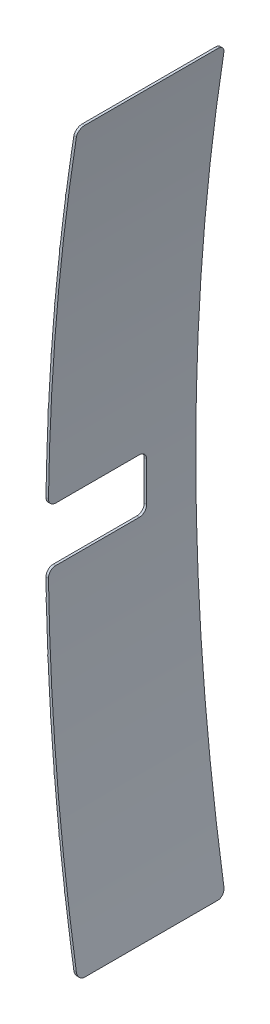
ISO-10303-21;
HEADER;
FILE_DESCRIPTION(('STEP AP214'),'2;1');
FILE_NAME('part.step','',(''),(''),'','','');
FILE_SCHEMA(('AUTOMOTIVE_DESIGN { 1 0 10303 214 1 1 1 1 }'));
ENDSEC;
DATA;
#1=APPLICATION_CONTEXT('core data for automotive mechanical design processes');
#2=APPLICATION_PROTOCOL_DEFINITION('international standard','automotive_design',2000,#1);
#3=PRODUCT_CONTEXT('',#1,'mechanical');
#4=PRODUCT('Part','Part','',(#3));
#5=PRODUCT_RELATED_PRODUCT_CATEGORY('part','',(#4));
#6=PRODUCT_DEFINITION_FORMATION('','',#4);
#7=PRODUCT_DEFINITION_CONTEXT('part definition',#1,'design');
#8=PRODUCT_DEFINITION('design','',#6,#7);
#9=PRODUCT_DEFINITION_SHAPE('','',#8);
#10=(LENGTH_UNIT() NAMED_UNIT(*) SI_UNIT(.MILLI.,.METRE.));
#11=(NAMED_UNIT(*) PLANE_ANGLE_UNIT() SI_UNIT($,.RADIAN.));
#12=(NAMED_UNIT(*) SI_UNIT($,.STERADIAN.) SOLID_ANGLE_UNIT());
#13=UNCERTAINTY_MEASURE_WITH_UNIT(LENGTH_MEASURE(1.E-05),#10,'distance_accuracy_value','');
#14=(GEOMETRIC_REPRESENTATION_CONTEXT(3) GLOBAL_UNCERTAINTY_ASSIGNED_CONTEXT((#13)) GLOBAL_UNIT_ASSIGNED_CONTEXT((#10,
#11,#12)) REPRESENTATION_CONTEXT('',''));
#15=CARTESIAN_POINT('',(0.,0.,0.));
#16=DIRECTION('',(0.,0.,1.));
#17=DIRECTION('',(1.,0.,0.));
#18=AXIS2_PLACEMENT_3D('',#15,#16,#17);
#19=CARTESIAN_POINT('',(0.,0.,6.));
#20=DIRECTION('',(0.,0.,-1.));
#21=DIRECTION('',(-1.,0.,0.));
#22=AXIS2_PLACEMENT_3D('',#19,#20,#21);
#23=CYLINDRICAL_SURFACE('',#22,95.1);
#24=CARTESIAN_POINT('',(0.,0.,6.));
#25=DIRECTION('',(0.,0.,1.));
#26=DIRECTION('',(1.,0.,0.));
#27=AXIS2_PLACEMENT_3D('',#24,#25,#26);
#28=CIRCLE('',#27,95.1);
#29=CARTESIAN_POINT('',(-95.0700823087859,2.38525675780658,6.));
#30=VERTEX_POINT('',#29);
#31=CARTESIAN_POINT('',(-95.0896944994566,1.4,6.));
#32=VERTEX_POINT('',#31);
#33=EDGE_CURVE('E1098',#30,#32,#28,.T.);
#34=ORIENTED_EDGE('',*,*,#33,.F.);
#35=DIRECTION('',(0.,0.,-1.));
#36=VECTOR('',#35,1.);
#37=CARTESIAN_POINT('',(-95.0700823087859,2.38525675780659,6.));
#38=LINE('',#37,#36);
#39=CARTESIAN_POINT('',(-95.0700823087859,2.38525675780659,2.));
#40=VERTEX_POINT('',#39);
#41=EDGE_CURVE('E961',#30,#40,#38,.T.);
#42=ORIENTED_EDGE('',*,*,#41,.T.);
#43=CARTESIAN_POINT('',(0.,0.,2.));
#44=DIRECTION('',(0.,0.,-1.));
#45=DIRECTION('',(-0.99963044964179,0.027183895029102,0.));
#46=AXIS2_PLACEMENT_3D('',#43,#44,#45);
#47=CIRCLE('',#46,95.1);
#48=CARTESIAN_POINT('',(-95.0648557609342,2.5851884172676,2.));
#49=VERTEX_POINT('',#48);
#50=EDGE_CURVE('E945',#40,#49,#47,.T.);
#51=ORIENTED_EDGE('',*,*,#50,.T.);
#52=DIRECTION('',(0.,0.,1.));
#53=VECTOR('',#52,1.);
#54=CARTESIAN_POINT('',(-95.0648557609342,2.5851884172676,2.));
#55=LINE('',#54,#53);
#56=CARTESIAN_POINT('',(-95.0648557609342,2.58518841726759,6.));
#57=VERTEX_POINT('',#56);
#58=EDGE_CURVE('E951',#49,#57,#55,.T.);
#59=ORIENTED_EDGE('',*,*,#58,.T.);
#60=CARTESIAN_POINT('',(-94.998899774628,4.38395273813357,6.));
#61=VERTEX_POINT('',#60);
#62=EDGE_CURVE('E977',#61,#57,#28,.T.);
#63=ORIENTED_EDGE('',*,*,#62,.F.);
#64=DIRECTION('',(0.,0.,-1.));
#65=VECTOR('',#64,1.);
#66=CARTESIAN_POINT('',(-94.998899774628,4.38395273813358,5.99999999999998));
#67=LINE('',#66,#65);
#68=CARTESIAN_POINT('',(-94.998899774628,4.38395273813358,1.99999999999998));
#69=VERTEX_POINT('',#68);
#70=EDGE_CURVE('E957',#61,#69,#67,.T.);
#71=ORIENTED_EDGE('',*,*,#70,.T.);
#72=CARTESIAN_POINT('',(0.,0.,1.99999999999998));
#73=DIRECTION('',(0.,0.,-1.));
#74=DIRECTION('',(-0.998837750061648,0.0481990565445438,0.));
#75=AXIS2_PLACEMENT_3D('',#72,#73,#74);
#76=CIRCLE('',#75,95.1);
#77=CARTESIAN_POINT('',(-94.9894700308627,4.58373027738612,1.99999999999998));
#78=VERTEX_POINT('',#77);
#79=EDGE_CURVE('E1004',#69,#78,#76,.T.);
#80=ORIENTED_EDGE('',*,*,#79,.T.);
#81=DIRECTION('',(0.,0.,1.));
#82=VECTOR('',#81,1.);
#83=CARTESIAN_POINT('',(-94.9894700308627,4.58373027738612,1.99999999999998));
#84=LINE('',#83,#82);
#85=CARTESIAN_POINT('',(-94.9894700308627,4.58373027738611,6.));
#86=VERTEX_POINT('',#85);
#87=EDGE_CURVE('E999',#78,#86,#84,.T.);
#88=ORIENTED_EDGE('',*,*,#87,.T.);
#89=CARTESIAN_POINT('',(-94.8857025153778,6.38070984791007,6.));
#90=VERTEX_POINT('',#89);
#91=EDGE_CURVE('E988',#90,#86,#28,.T.);
#92=ORIENTED_EDGE('',*,*,#91,.F.);
#93=DIRECTION('',(0.,0.,-1.));
#94=VECTOR('',#93,1.);
#95=CARTESIAN_POINT('',(-94.8857025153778,6.38070984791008,5.99999999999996));
#96=LINE('',#95,#94);
#97=CARTESIAN_POINT('',(-94.8857025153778,6.38070984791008,1.99999999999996));
#98=VERTEX_POINT('',#97);
#99=EDGE_CURVE('E1003',#90,#98,#96,.T.);
#100=ORIENTED_EDGE('',*,*,#99,.T.);
#101=CARTESIAN_POINT('',(0.,0.,1.99999999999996));
#102=DIRECTION('',(0.,0.,-1.));
#103=DIRECTION('',(-0.99760329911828,0.0691929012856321,0.));
#104=AXIS2_PLACEMENT_3D('',#101,#102,#103);
#105=CIRCLE('',#104,95.1);
#106=CARTESIAN_POINT('',(-94.8720737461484,6.58024491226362,1.99999999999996));
#107=VERTEX_POINT('',#106);
#108=EDGE_CURVE('E1041',#98,#107,#105,.T.);
#109=ORIENTED_EDGE('',*,*,#108,.T.);
#110=DIRECTION('',(0.,0.,1.));
#111=VECTOR('',#110,1.);
#112=CARTESIAN_POINT('',(-94.8720737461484,6.58024491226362,1.99999999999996));
#113=LINE('',#112,#111);
#114=CARTESIAN_POINT('',(-94.8720737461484,6.58024491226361,6.));
#115=VERTEX_POINT('',#114);
#116=EDGE_CURVE('E1037',#107,#115,#113,.T.);
#117=ORIENTED_EDGE('',*,*,#116,.T.);
#118=CARTESIAN_POINT('',(-94.7305405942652,8.37464499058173,6.));
#119=VERTEX_POINT('',#118);
#120=EDGE_CURVE('E1026',#119,#115,#28,.T.);
#121=ORIENTED_EDGE('',*,*,#120,.F.);
#122=DIRECTION('',(0.,0.,-1.));
#123=VECTOR('',#122,1.);
#124=CARTESIAN_POINT('',(-94.7305405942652,8.37464499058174,5.99999999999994));
#125=LINE('',#124,#123);
#126=CARTESIAN_POINT('',(-94.7305405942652,8.37464499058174,1.99999999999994));
#127=VERTEX_POINT('',#126);
#128=EDGE_CURVE('E530',#119,#127,#125,.T.);
#129=ORIENTED_EDGE('',*,*,#128,.T.);
#130=CARTESIAN_POINT('',(0.,0.,1.99999999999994));
#131=DIRECTION('',(0.,0.,-1.));
#132=DIRECTION('',(-0.995927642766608,0.090156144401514,0.));
#133=AXIS2_PLACEMENT_3D('',#130,#131,#132);
#134=CIRCLE('',#133,95.1);
#135=CARTESIAN_POINT('',(-94.7127188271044,8.57384933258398,1.99999999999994));
#136=VERTEX_POINT('',#135);
#137=EDGE_CURVE('E1076',#127,#136,#134,.T.);
#138=ORIENTED_EDGE('',*,*,#137,.T.);
#139=DIRECTION('',(0.,0.,1.));
#140=VECTOR('',#139,1.);
#141=CARTESIAN_POINT('',(-94.7127188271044,8.57384933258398,1.99999999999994));
#142=LINE('',#141,#140);
#143=CARTESIAN_POINT('',(-94.7127188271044,8.57384933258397,6.));
#144=VERTEX_POINT('',#143);
#145=EDGE_CURVE('E1072',#136,#144,#142,.T.);
#146=ORIENTED_EDGE('',*,*,#145,.T.);
#147=CARTESIAN_POINT('',(-94.5334826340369,10.3648763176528,6.));
#148=VERTEX_POINT('',#147);
#149=EDGE_CURVE('E1062',#148,#144,#28,.T.);
#150=ORIENTED_EDGE('',*,*,#149,.F.);
#151=DIRECTION('',(0.,0.,-1.));
#152=VECTOR('',#151,1.);
#153=CARTESIAN_POINT('',(-94.5334826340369,10.3648763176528,5.99999999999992));
#154=LINE('',#153,#152);
#155=CARTESIAN_POINT('',(-94.5334826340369,10.3648763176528,1.99999999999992));
#156=VERTEX_POINT('',#155);
#157=EDGE_CURVE('E1075',#148,#156,#154,.T.);
#158=ORIENTED_EDGE('',*,*,#157,.T.);
#159=CARTESIAN_POINT('',(0.,0.,1.99999999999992));
#160=DIRECTION('',(0.,0.,-1.));
#161=DIRECTION('',(-0.993811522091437,0.111079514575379,0.));
#162=AXIS2_PLACEMENT_3D('',#159,#160,#161);
#163=CIRCLE('',#162,95.1);
#164=CARTESIAN_POINT('',(-94.5114757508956,10.5636618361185,1.99999999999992));
#165=VERTEX_POINT('',#164);
#166=EDGE_CURVE('E1655',#156,#165,#163,.T.);
#167=ORIENTED_EDGE('',*,*,#166,.T.);
#168=DIRECTION('',(0.,0.,1.));
#169=VECTOR('',#168,1.);
#170=CARTESIAN_POINT('',(-94.5114757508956,10.5636618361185,1.99999999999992));
#171=LINE('',#170,#169);
#172=CARTESIAN_POINT('',(-94.5114757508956,10.5636618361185,6.));
#173=VERTEX_POINT('',#172);
#174=EDGE_CURVE('E1232',#165,#173,#171,.T.);
#175=ORIENTED_EDGE('',*,*,#174,.T.);
#176=CARTESIAN_POINT('',(-94.2946157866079,12.3505236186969,6.));
#177=VERTEX_POINT('',#176);
#178=EDGE_CURVE('E1094',#177,#173,#28,.T.);
#179=ORIENTED_EDGE('',*,*,#178,.F.);
#180=DIRECTION('',(0.,0.,-1.));
#181=VECTOR('',#180,1.);
#182=CARTESIAN_POINT('',(-94.2946157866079,12.3505236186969,5.9999999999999));
#183=LINE('',#182,#181);
#184=CARTESIAN_POINT('',(-94.2946157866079,12.3505236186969,1.9999999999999));
#185=VERTEX_POINT('',#184);
#186=EDGE_CURVE('E1229',#177,#185,#183,.T.);
#187=ORIENTED_EDGE('',*,*,#186,.T.);
#188=CARTESIAN_POINT('',(0.,0.,1.9999999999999));
#189=DIRECTION('',(0.,0.,-1.));
#190=DIRECTION('',(-0.991255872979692,0.131953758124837,0.));
#191=AXIS2_PLACEMENT_3D('',#188,#189,#190);
#192=CIRCLE('',#191,95.1);
#193=CARTESIAN_POINT('',(-94.2684335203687,12.548802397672,1.9999999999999));
#194=VERTEX_POINT('',#193);
#195=EDGE_CURVE('E1225',#185,#194,#192,.T.);
#196=ORIENTED_EDGE('',*,*,#195,.T.);
#197=DIRECTION('',(0.,0.,1.));
#198=VECTOR('',#197,1.);
#199=CARTESIAN_POINT('',(-94.2684335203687,12.548802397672,1.9999999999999));
#200=LINE('',#199,#198);
#201=CARTESIAN_POINT('',(-94.2684335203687,12.548802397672,6.));
#202=VERTEX_POINT('',#201);
#203=EDGE_CURVE('E1220',#194,#202,#200,.T.);
#204=ORIENTED_EDGE('',*,*,#203,.T.);
#205=CARTESIAN_POINT('',(-93.9570114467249,14.7,6.));
#206=VERTEX_POINT('',#205);
#207=EDGE_CURVE('E1112',#206,#202,#28,.T.);
#208=ORIENTED_EDGE('',*,*,#207,.F.);
#209=CARTESIAN_POINT('',(-93.9570114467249,14.7,6.));
#210=CARTESIAN_POINT('',(-93.9543467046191,14.7170332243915,6.00001359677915));
#211=CARTESIAN_POINT('',(-93.9516774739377,14.7340625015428,5.99855012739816));
#212=CARTESIAN_POINT('',(-93.9464065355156,14.7676327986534,5.99276879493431));
#213=CARTESIAN_POINT('',(-93.9438047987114,14.7841740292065,5.98845218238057));
#214=CARTESIAN_POINT('',(-93.9387413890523,14.8163130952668,5.97706078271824));
#215=CARTESIAN_POINT('',(-93.9362797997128,14.8319103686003,5.96998437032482));
#216=CARTESIAN_POINT('',(-93.9315718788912,14.8616967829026,5.95326971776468));
#217=CARTESIAN_POINT('',(-93.9293254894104,14.8758863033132,5.94363217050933));
#218=CARTESIAN_POINT('',(-93.9251270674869,14.9023717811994,5.92211543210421));
#219=CARTESIAN_POINT('',(-93.923173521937,14.9146774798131,5.91024853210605));
#220=CARTESIAN_POINT('',(-93.9196069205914,14.9371203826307,5.88456622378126));
#221=CARTESIAN_POINT('',(-93.9179939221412,14.9472572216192,5.87075048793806));
#222=CARTESIAN_POINT('',(-93.9151770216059,14.9649458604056,5.84173637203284));
#223=CARTESIAN_POINT('',(-93.9139686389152,14.9725259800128,5.82655567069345));
#224=CARTESIAN_POINT('',(-93.9119752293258,14.9850241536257,5.79511491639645));
#225=CARTESIAN_POINT('',(-93.9111898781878,14.9899442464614,5.77885570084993));
#226=CARTESIAN_POINT('',(-93.910281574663,14.9956333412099,5.75206492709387));
#227=CARTESIAN_POINT('',(-93.9100202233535,14.9972698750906,5.74171420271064));
#228=CARTESIAN_POINT('',(-93.9096715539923,14.9994529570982,5.72091056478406));
#229=CARTESIAN_POINT('',(-93.9095839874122,15.0000010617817,5.710457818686));
#230=CARTESIAN_POINT('',(-93.9095841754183,15.0000000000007,5.70000000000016));
#231=B_SPLINE_CURVE_WITH_KNOTS('',3,(#209,#210,#211,#212,#213,#214,#215,#216,#217,#218,#219,
#220,#221,#222,#223,#224,#225,#226,#227,#228,#229,#230),.UNSPECIFIED.,.F.,.F.,(4,2,2,2,2,2,2,2,
2,2,4),(0.,0.0516548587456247,0.103287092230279,0.154949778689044,0.206598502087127,
0.257970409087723,0.309350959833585,0.360142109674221,0.410894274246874,0.44228804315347,
0.473636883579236),.UNSPECIFIED.);
#232=CARTESIAN_POINT('',(-93.9095841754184,15.,5.7));
#233=VERTEX_POINT('',#232);
#234=EDGE_CURVE('E1224',#206,#233,#231,.T.);
#235=ORIENTED_EDGE('',*,*,#234,.T.);
#236=DIRECTION('',(0.,0.,-1.));
#237=VECTOR('',#236,1.);
#238=CARTESIAN_POINT('',(-93.9095841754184,15.,6.));
#239=LINE('',#238,#237);
#240=CARTESIAN_POINT('',(-93.9095841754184,15.,0.3));
#241=VERTEX_POINT('',#240);
#242=EDGE_CURVE('E1973',#233,#241,#239,.T.);
#243=ORIENTED_EDGE('',*,*,#242,.T.);
#244=CARTESIAN_POINT('',(-93.9095841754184,15.,0.3));
#245=CARTESIAN_POINT('',(-93.9095816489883,15.0000150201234,0.283274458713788));
#246=CARTESIAN_POINT('',(-93.9098074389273,14.9986022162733,0.266554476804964));
#247=CARTESIAN_POINT('',(-93.9106967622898,14.9930333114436,0.233608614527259));
#248=CARTESIAN_POINT('',(-93.9113597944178,14.9888803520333,0.217382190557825));
#249=CARTESIAN_POINT('',(-93.9131051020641,14.9779410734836,0.18586041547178));
#250=CARTESIAN_POINT('',(-93.9141875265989,14.9711538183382,0.170565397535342));
#251=CARTESIAN_POINT('',(-93.9167365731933,14.9551548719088,0.141338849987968));
#252=CARTESIAN_POINT('',(-93.9182031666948,14.9459433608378,0.127407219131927));
#253=CARTESIAN_POINT('',(-93.9214848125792,14.9253073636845,0.101213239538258));
#254=CARTESIAN_POINT('',(-93.9233017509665,14.9138708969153,0.088960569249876));
#255=CARTESIAN_POINT('',(-93.9272242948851,14.8891468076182,0.06654339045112));
#256=CARTESIAN_POINT('',(-93.9293299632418,14.8758587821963,0.0563793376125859));
#257=CARTESIAN_POINT('',(-93.9337944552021,14.8476417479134,0.0383015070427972));
#258=CARTESIAN_POINT('',(-93.9361560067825,14.8326950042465,0.0304161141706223));
#259=CARTESIAN_POINT('',(-93.9410422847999,14.8017167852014,0.0172695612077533));
#260=CARTESIAN_POINT('',(-93.9435669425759,14.785685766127,0.0120073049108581));
#261=CARTESIAN_POINT('',(-93.9479222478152,14.7579821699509,0.00542463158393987));
#262=CARTESIAN_POINT('',(-93.9497299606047,14.7464699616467,0.00339169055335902));
#263=CARTESIAN_POINT('',(-93.9533627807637,14.7233067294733,0.000679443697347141));
#264=CARTESIAN_POINT('',(-93.9551878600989,14.7116559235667,-1.7615575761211E-06));
#265=CARTESIAN_POINT('',(-93.9570114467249,14.7,0.));
#266=B_SPLINE_CURVE_WITH_KNOTS('',3,(#244,#245,#246,#247,#248,#249,#250,#251,#252,#253,#254,
#255,#256,#257,#258,#259,#260,#261,#262,#263,#264,#265),.UNSPECIFIED.,.F.,.F.,(4,2,2,2,2,2,2,2,
2,2,4),(0.,0.050107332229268,0.100157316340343,0.150225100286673,0.200289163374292,
0.250630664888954,0.300983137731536,0.351938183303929,0.402871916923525,0.438285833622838,
0.473649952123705),.UNSPECIFIED.);
#267=CARTESIAN_POINT('',(-93.9570114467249,14.7,0.));
#268=VERTEX_POINT('',#267);
#269=EDGE_CURVE('E1823',#241,#268,#266,.T.);
#270=ORIENTED_EDGE('',*,*,#269,.T.);
#271=CARTESIAN_POINT('',(0.,0.,0.));
#272=DIRECTION('',(0.,0.,1.));
#273=DIRECTION('',(1.,0.,0.));
#274=AXIS2_PLACEMENT_3D('',#271,#272,#273);
#275=CIRCLE('',#274,95.1);
#276=CARTESIAN_POINT('',(-95.0480757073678,3.1421814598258,0.));
#277=VERTEX_POINT('',#276);
#278=EDGE_CURVE('E1569',#268,#277,#275,.T.);
#279=ORIENTED_EDGE('',*,*,#278,.T.);
#280=CARTESIAN_POINT('',(-95.0998928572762,0.142753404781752,2.));
#281=CARTESIAN_POINT('',(-95.0983917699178,1.14275229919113,1.33333331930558));
#282=CARTESIAN_POINT('',(-95.0811165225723,2.14272743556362,0.666666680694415));
#283=CARTESIAN_POINT('',(-95.0480757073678,3.1421814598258,0.));
#284=B_SPLINE_CURVE_WITH_KNOTS('',3,(#280,#281,#282,#283),.UNSPECIFIED.,.F.,.F.,(4,4),(0.,1.),.UNSPECIFIED.);
#285=CARTESIAN_POINT('',(-95.0998932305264,0.142504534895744,2.));
#286=VERTEX_POINT('',#285);
#287=EDGE_CURVE('E1578',#277,#286,#284,.F.);
#288=ORIENTED_EDGE('',*,*,#287,.T.);
#289=CARTESIAN_POINT('',(0.,0.,2.));
#290=DIRECTION('',(0.,0.,-1.));
#291=DIRECTION('',(-1.,0.,0.));
#292=AXIS2_PLACEMENT_3D('',#289,#290,#291);
#293=CIRCLE('',#292,95.1);
#294=CARTESIAN_POINT('',(-95.0966350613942,0.8,2.));
#295=VERTEX_POINT('',#294);
#296=EDGE_CURVE('E1587',#286,#295,#293,.T.);
#297=ORIENTED_EDGE('',*,*,#296,.T.);
#298=CARTESIAN_POINT('',(-95.0966350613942,0.8,2.));
#299=CARTESIAN_POINT('',(-95.0964932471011,0.816878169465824,1.99998566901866));
#300=CARTESIAN_POINT('',(-95.0963466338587,0.833752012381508,2.00142350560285));
#301=CARTESIAN_POINT('',(-95.0960491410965,0.867009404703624,2.00709771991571));
#302=CARTESIAN_POINT('',(-95.0958982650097,0.883393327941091,2.01133190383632));
#303=CARTESIAN_POINT('',(-95.095597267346,0.915224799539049,2.02249600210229));
#304=CARTESIAN_POINT('',(-95.0954471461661,0.930671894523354,2.02942720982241));
#305=CARTESIAN_POINT('',(-95.0951537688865,0.960180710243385,2.04578258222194));
#306=CARTESIAN_POINT('',(-95.0950105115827,0.974242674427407,2.05520630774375));
#307=CARTESIAN_POINT('',(-95.094736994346,1.0005848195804,2.07628077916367));
#308=CARTESIAN_POINT('',(-95.0946067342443,1.01286502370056,2.08793149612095));
#309=CARTESIAN_POINT('',(-95.0943651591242,1.0352976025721,2.11313209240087));
#310=CARTESIAN_POINT('',(-95.0942538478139,1.04544956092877,2.12668234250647));
#311=CARTESIAN_POINT('',(-95.0940555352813,1.06333539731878,2.15529585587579));
#312=CARTESIAN_POINT('',(-95.0939685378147,1.07106890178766,2.17035935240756));
#313=CARTESIAN_POINT('',(-95.0938232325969,1.08389316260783,2.20156805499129));
#314=CARTESIAN_POINT('',(-95.0937649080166,1.08898546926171,2.21771262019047));
#315=CARTESIAN_POINT('',(-95.0936944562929,1.09511667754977,2.24496339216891));
#316=CARTESIAN_POINT('',(-95.0936733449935,1.09694681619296,2.25589810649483));
#317=CARTESIAN_POINT('',(-95.0936451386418,1.09938831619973,2.27788701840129));
#318=CARTESIAN_POINT('',(-95.0936380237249,1.1000014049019,2.28894102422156));
#319=CARTESIAN_POINT('',(-95.0936380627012,1.10000000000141,2.29999999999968));
#320=B_SPLINE_CURVE_WITH_KNOTS('',3,(#298,#299,#300,#301,#302,#303,#304,#305,#306,#307,#308,
#309,#310,#311,#312,#313,#314,#315,#316,#317,#318,#319),.UNSPECIFIED.,.F.,.F.,(4,2,2,2,2,2,2,2,
2,2,4),(0.,0.0505690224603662,0.101098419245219,0.151652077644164,0.202196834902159,
0.252740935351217,0.303294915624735,0.353856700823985,0.40438877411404,0.437586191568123,
0.470736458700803),.UNSPECIFIED.);
#321=CARTESIAN_POINT('',(-95.0936380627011,1.1,2.3));
#322=VERTEX_POINT('',#321);
#323=EDGE_CURVE('E2590',#295,#322,#320,.T.);
#324=ORIENTED_EDGE('',*,*,#323,.T.);
#325=DIRECTION('',(0.,0.,-1.));
#326=VECTOR('',#325,1.);
#327=CARTESIAN_POINT('',(-95.0936380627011,1.1,6.));
#328=LINE('',#327,#326);
#329=CARTESIAN_POINT('',(-95.0936380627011,1.1,5.7));
#330=VERTEX_POINT('',#329);
#331=EDGE_CURVE('E1131',#322,#330,#328,.F.);
#332=ORIENTED_EDGE('',*,*,#331,.T.);
#333=CARTESIAN_POINT('',(-95.0936380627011,1.1,5.7));
#334=CARTESIAN_POINT('',(-95.0936381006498,1.09998566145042,5.71687660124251));
#335=CARTESIAN_POINT('',(-95.0936215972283,1.10142324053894,5.73374891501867));
#336=CARTESIAN_POINT('',(-95.093555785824,1.10709642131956,5.76700332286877));
#337=CARTESIAN_POINT('',(-95.0935065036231,1.11132982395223,5.78338579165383));
#338=CARTESIAN_POINT('',(-95.0933753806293,1.12249182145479,5.81521448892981));
#339=CARTESIAN_POINT('',(-95.0932935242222,1.12942170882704,5.83066026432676));
#340=CARTESIAN_POINT('',(-95.0930979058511,1.14577384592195,5.86016665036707));
#341=CARTESIAN_POINT('',(-95.0929841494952,1.15519565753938,5.87422750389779));
#342=CARTESIAN_POINT('',(-95.0927258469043,1.17626593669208,5.90056812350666));
#343=CARTESIAN_POINT('',(-95.0925813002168,1.1879144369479,5.91284786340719));
#344=CARTESIAN_POINT('',(-95.0922632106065,1.21311000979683,5.93527991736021));
#345=CARTESIAN_POINT('',(-95.0920896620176,1.22665745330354,5.94543181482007));
#346=CARTESIAN_POINT('',(-95.0917163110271,1.2552663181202,5.96331911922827));
#347=CARTESIAN_POINT('',(-95.0915165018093,1.2703281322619,5.97105389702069));
#348=CARTESIAN_POINT('',(-95.0910945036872,1.30153328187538,5.98388104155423));
#349=CARTESIAN_POINT('',(-95.0908723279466,1.31767597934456,5.98897495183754));
#350=CARTESIAN_POINT('',(-95.0904899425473,1.34493109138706,5.99511090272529));
#351=CARTESIAN_POINT('',(-95.0903345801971,1.35587219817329,5.99694321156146));
#352=CARTESIAN_POINT('',(-95.0900183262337,1.37787401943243,5.9993875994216));
#353=CARTESIAN_POINT('',(-95.0898574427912,1.38893454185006,6.00000140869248));
#354=CARTESIAN_POINT('',(-95.0896944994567,1.39999999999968,6.00000000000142));
#355=B_SPLINE_CURVE_WITH_KNOTS('',3,(#333,#334,#335,#336,#337,#338,#339,#340,#341,#342,#343,
#344,#345,#346,#347,#348,#349,#350,#351,#352,#353,#354),.UNSPECIFIED.,.F.,.F.,(4,2,2,2,2,2,2,2,
2,2,4),(0.,0.0505625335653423,0.101085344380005,0.151632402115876,0.202170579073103,
0.252709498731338,0.303258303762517,0.353820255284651,0.404352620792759,0.437573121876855,
0.470746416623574),.UNSPECIFIED.);
#356=EDGE_CURVE('E1123',#330,#32,#355,.T.);
#357=ORIENTED_EDGE('',*,*,#356,.T.);
#358=EDGE_LOOP('',(#34,#42,#51,#59,#63,#71,#80,#88,#92,#100,#109,#117,#121,#129,#138,#146,#150,
#158,#167,#175,#179,#187,#196,#204,#208,#235,#243,#270,#279,#288,#297,#324,#332,#357));
#359=FACE_BOUND('',#358,.T.);
#360=ADVANCED_FACE('F526',(#359),#23,.T.);
#361=CARTESIAN_POINT('',(0.,0.,6.));
#362=DIRECTION('',(0.,0.,1.));
#363=DIRECTION('',(1.,0.,0.));
#364=AXIS2_PLACEMENT_3D('',#361,#362,#363);
#365=PLANE('',#364);
#366=ORIENTED_EDGE('',*,*,#207,.T.);
#367=DIRECTION('',(0.991255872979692,-0.131953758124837,0.));
#368=VECTOR('',#367,1.);
#369=CARTESIAN_POINT('',(-94.2684335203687,12.548802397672,6.));
#370=LINE('',#369,#368);
#371=CARTESIAN_POINT('',(-94.2783460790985,12.5501219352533,6.));
#372=VERTEX_POINT('',#371);
#373=EDGE_CURVE('E1201',#372,#202,#370,.T.);
#374=ORIENTED_EDGE('',*,*,#373,.F.);
#375=CARTESIAN_POINT('',(0.,0.,6.));
#376=DIRECTION('',(0.,0.,-1.));
#377=DIRECTION('',(-1.,0.,0.));
#378=AXIS2_PLACEMENT_3D('',#375,#376,#377);
#379=CIRCLE('',#378,95.11);
#380=CARTESIAN_POINT('',(-94.3045310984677,12.3518223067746,6.));
#381=VERTEX_POINT('',#380);
#382=EDGE_CURVE('E1122',#372,#381,#379,.F.);
#383=ORIENTED_EDGE('',*,*,#382,.T.);
#384=DIRECTION('',(0.991531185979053,-0.129868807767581,0.));
#385=VECTOR('',#384,1.);
#386=CARTESIAN_POINT('',(-94.2946157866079,12.3505236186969,6.));
#387=LINE('',#386,#385);
#388=EDGE_CURVE('E1129',#381,#177,#387,.T.);
#389=ORIENTED_EDGE('',*,*,#388,.T.);
#390=ORIENTED_EDGE('',*,*,#178,.T.);
#391=DIRECTION('',(0.993811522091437,-0.111079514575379,0.));
#392=VECTOR('',#391,1.);
#393=CARTESIAN_POINT('',(-94.5114757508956,10.5636618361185,6.));
#394=LINE('',#393,#392);
#395=CARTESIAN_POINT('',(-94.5214138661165,10.5647726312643,6.));
#396=VERTEX_POINT('',#395);
#397=EDGE_CURVE('E1065',#396,#173,#394,.T.);
#398=ORIENTED_EDGE('',*,*,#397,.F.);
#399=CARTESIAN_POINT('',(0.,0.,6.));
#400=DIRECTION('',(0.,0.,-1.));
#401=DIRECTION('',(-1.,0.,0.));
#402=AXIS2_PLACEMENT_3D('',#399,#400,#401);
#403=CIRCLE('',#402,95.11);
#404=CARTESIAN_POINT('',(-94.543423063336,10.3659662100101,6.));
#405=VERTEX_POINT('',#404);
#406=EDGE_CURVE('E1192',#396,#405,#403,.F.);
#407=ORIENTED_EDGE('',*,*,#406,.T.);
#408=DIRECTION('',(0.994042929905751,-0.108989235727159,0.));
#409=VECTOR('',#408,1.);
#410=CARTESIAN_POINT('',(-94.5334826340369,10.3648763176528,6.));
#411=LINE('',#410,#409);
#412=EDGE_CURVE('E1093',#405,#148,#411,.T.);
#413=ORIENTED_EDGE('',*,*,#412,.T.);
#414=ORIENTED_EDGE('',*,*,#149,.T.);
#415=DIRECTION('',(0.995927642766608,-0.0901561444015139,0.));
#416=VECTOR('',#415,1.);
#417=CARTESIAN_POINT('',(-94.7127188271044,8.57384933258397,6.));
#418=LINE('',#417,#416);
#419=CARTESIAN_POINT('',(-94.7226781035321,8.574750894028,6.));
#420=VERTEX_POINT('',#419);
#421=EDGE_CURVE('E1030',#420,#144,#418,.T.);
#422=ORIENTED_EDGE('',*,*,#421,.F.);
#423=CARTESIAN_POINT('',(0.,0.,6.));
#424=DIRECTION('',(0.,0.,-1.));
#425=DIRECTION('',(-1.,0.,0.));
#426=AXIS2_PLACEMENT_3D('',#423,#424,#425);
#427=CIRCLE('',#426,95.11);
#428=CARTESIAN_POINT('',(-94.7405017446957,8.37552560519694,6.));
#429=VERTEX_POINT('',#428);
#430=EDGE_CURVE('E1053',#420,#429,#427,.F.);
#431=ORIENTED_EDGE('',*,*,#430,.T.);
#432=DIRECTION('',(0.99611504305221,-0.0880614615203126,0.));
#433=VECTOR('',#432,1.);
#434=CARTESIAN_POINT('',(-94.7305405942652,8.37464499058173,6.));
#435=LINE('',#434,#433);
#436=EDGE_CURVE('E1051',#429,#119,#435,.T.);
#437=ORIENTED_EDGE('',*,*,#436,.T.);
#438=ORIENTED_EDGE('',*,*,#120,.T.);
#439=DIRECTION('',(0.99760329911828,-0.0691929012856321,0.));
#440=VECTOR('',#439,1.);
#441=CARTESIAN_POINT('',(-94.8720737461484,6.58024491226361,6.));
#442=LINE('',#441,#440);
#443=CARTESIAN_POINT('',(-94.8820497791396,6.58093684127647,6.));
#444=VERTEX_POINT('',#443);
#445=EDGE_CURVE('E992',#444,#115,#442,.T.);
#446=ORIENTED_EDGE('',*,*,#445,.F.);
#447=CARTESIAN_POINT('',(0.,0.,6.));
#448=DIRECTION('',(0.,0.,-1.));
#449=DIRECTION('',(-1.,0.,0.));
#450=AXIS2_PLACEMENT_3D('',#447,#448,#449);
#451=CIRCLE('',#450,95.11);
#452=CARTESIAN_POINT('',(-94.8956799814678,6.38138079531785,6.));
#453=VERTEX_POINT('',#452);
#454=EDGE_CURVE('E1016',#444,#453,#451,.F.);
#455=ORIENTED_EDGE('',*,*,#454,.T.);
#456=DIRECTION('',(0.997746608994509,-0.0670947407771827,0.));
#457=VECTOR('',#456,1.);
#458=CARTESIAN_POINT('',(-94.8857025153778,6.38070984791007,6.));
#459=LINE('',#458,#457);
#460=EDGE_CURVE('E1013',#453,#90,#459,.T.);
#461=ORIENTED_EDGE('',*,*,#460,.T.);
#462=ORIENTED_EDGE('',*,*,#91,.T.);
#463=DIRECTION('',(0.998837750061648,-0.0481990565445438,0.));
#464=VECTOR('',#463,1.);
#465=CARTESIAN_POINT('',(-94.9894700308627,4.58373027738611,6.));
#466=LINE('',#465,#464);
#467=CARTESIAN_POINT('',(-94.9994584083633,4.58421226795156,6.));
#468=VERTEX_POINT('',#467);
#469=EDGE_CURVE('E970',#468,#86,#466,.T.);
#470=ORIENTED_EDGE('',*,*,#469,.F.);
#471=CARTESIAN_POINT('',(0.,0.,6.));
#472=DIRECTION('',(0.,0.,-1.));
#473=DIRECTION('',(-1.,0.,0.));
#474=AXIS2_PLACEMENT_3D('',#471,#472,#473);
#475=CIRCLE('',#474,95.11);
#476=CARTESIAN_POINT('',(-95.0088891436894,4.3844137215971,6.));
#477=VERTEX_POINT('',#476);
#478=EDGE_CURVE('E978',#468,#477,#475,.F.);
#479=ORIENTED_EDGE('',*,*,#478,.T.);
#480=DIRECTION('',(0.998936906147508,-0.0460983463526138,0.));
#481=VECTOR('',#480,1.);
#482=CARTESIAN_POINT('',(-94.998899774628,4.38395273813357,6.));
#483=LINE('',#482,#481);
#484=EDGE_CURVE('E974',#477,#61,#483,.T.);
#485=ORIENTED_EDGE('',*,*,#484,.T.);
#486=ORIENTED_EDGE('',*,*,#62,.T.);
#487=DIRECTION('',(0.99963044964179,-0.0271838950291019,0.));
#488=VECTOR('',#487,1.);
#489=CARTESIAN_POINT('',(-95.0648557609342,2.58518841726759,6.));
#490=LINE('',#489,#488);
#491=CARTESIAN_POINT('',(-95.0748520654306,2.58546025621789,6.));
#492=VERTEX_POINT('',#491);
#493=EDGE_CURVE('E13',#492,#57,#490,.T.);
#494=ORIENTED_EDGE('',*,*,#493,.F.);
#495=CARTESIAN_POINT('',(0.,0.,6.));
#496=DIRECTION('',(0.,0.,-1.));
#497=DIRECTION('',(-1.,0.,0.));
#498=AXIS2_PLACEMENT_3D('',#495,#496,#497);
#499=CIRCLE('',#498,95.11);
#500=CARTESIAN_POINT('',(-95.0800791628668,2.38550757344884,6.));
#501=VERTEX_POINT('',#500);
#502=EDGE_CURVE('E1097',#492,#501,#499,.F.);
#503=ORIENTED_EDGE('',*,*,#502,.T.);
#504=DIRECTION('',(0.999685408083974,-0.0250815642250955,0.));
#505=VECTOR('',#504,1.);
#506=CARTESIAN_POINT('',(-95.0700823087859,2.38525675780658,6.));
#507=LINE('',#506,#505);
#508=EDGE_CURVE('E1101',#501,#30,#507,.T.);
#509=ORIENTED_EDGE('',*,*,#508,.T.);
#510=ORIENTED_EDGE('',*,*,#33,.T.);
#511=DIRECTION('',(-1.,0.,0.));
#512=VECTOR('',#511,1.);
#513=CARTESIAN_POINT('',(-94.9936313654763,1.4,6.));
#514=LINE('',#513,#512);
#515=CARTESIAN_POINT('',(-94.9896836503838,1.4,6.));
#516=VERTEX_POINT('',#515);
#517=EDGE_CURVE('E1103',#32,#516,#514,.F.);
#518=ORIENTED_EDGE('',*,*,#517,.T.);
#519=CARTESIAN_POINT('',(0.,0.,6.));
#520=DIRECTION('',(0.,0.,-1.));
#521=DIRECTION('',(1.,0.,0.));
#522=AXIS2_PLACEMENT_3D('',#519,#520,#521);
#523=CIRCLE('',#522,95.);
#524=CARTESIAN_POINT('',(-93.855793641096,14.7,6.));
#525=VERTEX_POINT('',#524);
#526=EDGE_CURVE('E1106',#516,#525,#523,.T.);
#527=ORIENTED_EDGE('',*,*,#526,.T.);
#528=DIRECTION('',(-1.,0.,0.));
#529=VECTOR('',#528,1.);
#530=CARTESIAN_POINT('',(-93.9095841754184,14.7,6.));
#531=LINE('',#530,#529);
#532=EDGE_CURVE('E1454',#525,#206,#531,.T.);
#533=ORIENTED_EDGE('',*,*,#532,.T.);
#534=EDGE_LOOP('',(#366,#374,#383,#389,#390,#398,#407,#413,#414,#422,#431,#437,#438,#446,#455,
#461,#462,#470,#479,#485,#486,#494,#503,#509,#510,#518,#527,#533));
#535=FACE_BOUND('',#534,.T.);
#536=ADVANCED_FACE('F1432',(#535),#365,.T.);
#537=CARTESIAN_POINT('',(0.,0.,6.));
#538=DIRECTION('',(0.,0.,-1.));
#539=DIRECTION('',(-1.,0.,0.));
#540=AXIS2_PLACEMENT_3D('',#537,#538,#539);
#541=CYLINDRICAL_SURFACE('',#540,95.);
#542=ORIENTED_EDGE('',*,*,#526,.F.);
#543=CARTESIAN_POINT('',(-94.9896836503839,1.4,6.));
#544=CARTESIAN_POINT('',(-94.9899325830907,1.38312174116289,6.0000143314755));
#545=CARTESIAN_POINT('',(-94.9901766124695,1.36624767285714,5.99857647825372));
#546=CARTESIAN_POINT('',(-94.9906490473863,1.33298955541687,5.99290206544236));
#547=CARTESIAN_POINT('',(-94.9908774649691,1.31660513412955,5.98866769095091));
#548=CARTESIAN_POINT('',(-94.9913133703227,1.28477246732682,5.97750290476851));
#549=CARTESIAN_POINT('',(-94.9915208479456,1.26932467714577,5.97057119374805));
#550=CARTESIAN_POINT('',(-94.9919105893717,1.23981447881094,5.95421444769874));
#551=CARTESIAN_POINT('',(-94.9920928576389,1.22575182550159,5.94478985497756));
#552=CARTESIAN_POINT('',(-94.9924291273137,1.19940923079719,5.92371389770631));
#553=CARTESIAN_POINT('',(-94.9925831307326,1.18712916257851,5.91206269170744));
#554=CARTESIAN_POINT('',(-94.9928608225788,1.16469690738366,5.88686102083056));
#555=CARTESIAN_POINT('',(-94.9929845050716,1.15454513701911,5.87331018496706));
#556=CARTESIAN_POINT('',(-94.9932001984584,1.1366601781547,5.844696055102));
#557=CARTESIAN_POINT('',(-94.9932922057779,1.128927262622,5.82963259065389));
#558=CARTESIAN_POINT('',(-94.9934437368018,1.11610411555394,5.79842404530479));
#559=CARTESIAN_POINT('',(-94.9935032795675,1.11101233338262,5.78227960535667));
#560=CARTESIAN_POINT('',(-94.9935747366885,1.10488217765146,5.75503020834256));
#561=CARTESIAN_POINT('',(-94.9935959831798,1.1030524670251,5.74409674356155));
#562=CARTESIAN_POINT('',(-94.9936242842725,1.1006115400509,5.7221103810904));
#563=CARTESIAN_POINT('',(-94.9936313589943,1.0999985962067,5.71105767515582));
#564=CARTESIAN_POINT('',(-94.9936313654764,1.09999999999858,5.70000000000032));
#565=B_SPLINE_CURVE_WITH_KNOTS('',3,(#543,#544,#545,#546,#547,#548,#549,#550,#551,#552,#553,
#554,#555,#556,#557,#558,#559,#560,#561,#562,#563,#564),.UNSPECIFIED.,.F.,.F.,(4,2,2,2,2,2,2,2,
2,2,4),(0.,0.0505730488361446,0.10110662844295,0.151664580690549,0.202213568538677,
0.252758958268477,0.303314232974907,0.353875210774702,0.404406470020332,0.437600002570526,
0.470746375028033),.UNSPECIFIED.);
#566=CARTESIAN_POINT('',(-94.9936313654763,1.1,5.7));
#567=VERTEX_POINT('',#566);
#568=EDGE_CURVE('E1443',#516,#567,#565,.T.);
#569=ORIENTED_EDGE('',*,*,#568,.T.);
#570=DIRECTION('',(0.,0.,-1.));
#571=VECTOR('',#570,1.);
#572=CARTESIAN_POINT('',(-94.9936313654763,1.1,6.));
#573=LINE('',#572,#571);
#574=CARTESIAN_POINT('',(-94.9936313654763,1.1,2.3));
#575=VERTEX_POINT('',#574);
#576=EDGE_CURVE('E1480',#567,#575,#573,.T.);
#577=ORIENTED_EDGE('',*,*,#576,.T.);
#578=CARTESIAN_POINT('',(-94.9936313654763,1.1,2.3));
#579=CARTESIAN_POINT('',(-94.9936310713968,1.10001433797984,2.28312326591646));
#580=CARTESIAN_POINT('',(-94.9936478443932,1.09857673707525,2.26625082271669));
#581=CARTESIAN_POINT('',(-94.9937133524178,1.09290347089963,2.23299617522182));
#582=CARTESIAN_POINT('',(-94.9937620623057,1.08867000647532,2.21661359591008));
#583=CARTESIAN_POINT('',(-94.9938893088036,1.07750784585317,2.1847846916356));
#584=CARTESIAN_POINT('',(-94.9939678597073,1.07057785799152,2.16933881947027));
#585=CARTESIAN_POINT('',(-94.9941507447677,1.05422545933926,2.13983223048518));
#586=CARTESIAN_POINT('',(-94.9942550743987,1.04480348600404,2.12577127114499));
#587=CARTESIAN_POINT('',(-94.994484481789,1.02373267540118,2.09943029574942));
#588=CARTESIAN_POINT('',(-94.9946095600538,1.01208378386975,2.08715032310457));
#589=CARTESIAN_POINT('',(-94.9948746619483,0.986887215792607,2.06471784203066));
#590=CARTESIAN_POINT('',(-94.9950146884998,0.973339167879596,2.05456575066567));
#591=CARTESIAN_POINT('',(-94.9953035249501,0.944728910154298,2.03667821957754));
#592=CARTESIAN_POINT('',(-94.9954523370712,0.929666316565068,2.02894339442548));
#593=CARTESIAN_POINT('',(-94.9957526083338,0.898459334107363,2.0161163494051));
#594=CARTESIAN_POINT('',(-94.995904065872,0.882315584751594,2.01102258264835));
#595=CARTESIAN_POINT('',(-94.9961524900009,0.855060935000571,2.00488767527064));
#596=CARTESIAN_POINT('',(-94.9962503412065,0.844121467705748,2.00305590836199));
#597=CARTESIAN_POINT('',(-94.9964432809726,0.822122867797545,2.00061223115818));
#598=CARTESIAN_POINT('',(-94.9965383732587,0.811063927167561,1.99999859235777));
#599=CARTESIAN_POINT('',(-94.9966315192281,0.80000000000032,1.99999999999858));
#600=B_SPLINE_CURVE_WITH_KNOTS('',3,(#578,#579,#580,#581,#582,#583,#584,#585,#586,#587,#588,
#589,#590,#591,#592,#593,#594,#595,#596,#597,#598,#599),.UNSPECIFIED.,.F.,.F.,(4,2,2,2,2,2,2,2,
2,2,4),(0.,0.050562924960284,0.1010860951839,0.151633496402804,0.202172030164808,
0.252711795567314,0.303261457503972,0.353823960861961,0.404356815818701,0.437570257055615,
0.47073653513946),.UNSPECIFIED.);
#601=CARTESIAN_POINT('',(-94.9966315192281,0.8,2.));
#602=VERTEX_POINT('',#601);
#603=EDGE_CURVE('E2593',#575,#602,#600,.T.);
#604=ORIENTED_EDGE('',*,*,#603,.T.);
#605=CARTESIAN_POINT('',(0.,0.,2.));
#606=DIRECTION('',(0.,0.,-1.));
#607=DIRECTION('',(-1.,0.,0.));
#608=AXIS2_PLACEMENT_3D('',#605,#606,#607);
#609=CIRCLE('',#608,95.);
#610=CARTESIAN_POINT('',(-94.9966315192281,-0.8,2.));
#611=VERTEX_POINT('',#610);
#612=EDGE_CURVE('E1541',#602,#611,#609,.F.);
#613=ORIENTED_EDGE('',*,*,#612,.T.);
#614=CARTESIAN_POINT('',(-94.9966315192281,-0.8,2.));
#615=CARTESIAN_POINT('',(-94.9964895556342,-0.81687817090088,1.99998566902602));
#616=CARTESIAN_POINT('',(-94.9963427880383,-0.833752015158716,2.00142350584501));
#617=CARTESIAN_POINT('',(-94.9960449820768,-0.867009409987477,2.00709772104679));
#618=CARTESIAN_POINT('',(-94.9958939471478,-0.88339333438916,2.0113319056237));
#619=CARTESIAN_POINT('',(-94.9955926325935,-0.915224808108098,2.02249600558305));
#620=CARTESIAN_POINT('',(-94.9954423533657,-0.930671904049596,2.02942721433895));
#621=CARTESIAN_POINT('',(-94.9951486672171,-0.960180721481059,2.04578258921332));
#622=CARTESIAN_POINT('',(-94.9950052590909,-0.974242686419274,2.05520631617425));
#623=CARTESIAN_POINT('',(-94.9947314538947,-1.00058483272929,2.07628079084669));
#624=CARTESIAN_POINT('',(-94.9946010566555,-1.01286503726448,2.08793150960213));
#625=CARTESIAN_POINT('',(-94.9943592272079,-1.03529761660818,2.11313210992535));
#626=CARTESIAN_POINT('',(-94.9942477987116,-1.04544957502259,2.12668236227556));
#627=CARTESIAN_POINT('',(-94.9940492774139,-1.06333541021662,2.15529587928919));
#628=CARTESIAN_POINT('',(-94.9939621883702,-1.07106891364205,2.17035937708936));
#629=CARTESIAN_POINT('',(-94.993816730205,-1.08389317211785,2.20156808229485));
#630=CARTESIAN_POINT('',(-94.9937583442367,-1.08898547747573,2.21771264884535));
#631=CARTESIAN_POINT('',(-94.9936878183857,-1.09511668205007,2.24496341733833));
#632=CARTESIAN_POINT('',(-94.9936666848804,-1.09694681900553,2.2558981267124));
#633=CARTESIAN_POINT('',(-94.9936384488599,-1.09938831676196,2.27788702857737));
#634=CARTESIAN_POINT('',(-94.9936313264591,-1.10000140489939,2.28894102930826));
#635=CARTESIAN_POINT('',(-94.9936313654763,-1.10000000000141,2.29999999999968));
#636=B_SPLINE_CURVE_WITH_KNOTS('',3,(#614,#615,#616,#617,#618,#619,#620,#621,#622,#623,#624,
#625,#626,#627,#628,#629,#630,#631,#632,#633,#634,#635),.UNSPECIFIED.,.F.,.F.,(4,2,2,2,2,2,2,2,
2,2,4),(0.,0.0505690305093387,0.101098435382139,0.151652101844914,0.202196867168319,
0.252740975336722,0.303294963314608,0.353856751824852,0.404388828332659,0.437586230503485,
0.470736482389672),.UNSPECIFIED.);
#637=CARTESIAN_POINT('',(-94.9936313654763,-1.1,2.3));
#638=VERTEX_POINT('',#637);
#639=EDGE_CURVE('E1533',#611,#638,#636,.T.);
#640=ORIENTED_EDGE('',*,*,#639,.T.);
#641=DIRECTION('',(0.,0.,-1.));
#642=VECTOR('',#641,1.);
#643=CARTESIAN_POINT('',(-94.9936313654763,-1.1,6.));
#644=LINE('',#643,#642);
#645=CARTESIAN_POINT('',(-94.9936313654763,-1.1,5.7));
#646=VERTEX_POINT('',#645);
#647=EDGE_CURVE('E1540',#638,#646,#644,.F.);
#648=ORIENTED_EDGE('',*,*,#647,.T.);
#649=CARTESIAN_POINT('',(-94.9936313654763,-1.1,5.7));
#650=CARTESIAN_POINT('',(-94.9936314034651,-1.09998566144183,5.71687659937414));
#651=CARTESIAN_POINT('',(-94.9936148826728,-1.10142324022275,5.73374891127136));
#652=CARTESIAN_POINT('',(-94.993549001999,-1.10709641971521,5.76700331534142));
#653=CARTESIAN_POINT('',(-94.9934996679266,-1.11132982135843,5.78338578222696));
#654=CARTESIAN_POINT('',(-94.9933684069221,-1.12249181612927,5.81521447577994));
#655=CARTESIAN_POINT('',(-94.9932864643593,-1.12942170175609,5.83066024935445));
#656=CARTESIAN_POINT('',(-94.9930906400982,-1.14577383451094,5.86016663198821));
#657=CARTESIAN_POINT('',(-94.9929767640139,-1.15519564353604,5.87422748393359));
#658=CARTESIAN_POINT('',(-94.9927181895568,-1.17626591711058,5.90056810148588));
#659=CARTESIAN_POINT('',(-94.9925734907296,-1.18791441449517,5.91284784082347));
#660=CARTESIAN_POINT('',(-94.9922550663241,-1.21310998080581,5.93527989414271));
#661=CARTESIAN_POINT('',(-94.9920813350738,-1.22665742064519,5.94543179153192));
#662=CARTESIAN_POINT('',(-94.9917075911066,-1.2552662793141,5.96331909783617));
#663=CARTESIAN_POINT('',(-94.9915075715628,-1.27032809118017,5.97105387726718));
#664=CARTESIAN_POINT('',(-94.9910851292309,-1.30153323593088,5.98388102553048));
#665=CARTESIAN_POINT('',(-94.9908627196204,-1.3176759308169,5.98897493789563));
#666=CARTESIAN_POINT('',(-94.9904799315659,-1.34493104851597,5.99511089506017));
#667=CARTESIAN_POINT('',(-94.9903244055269,-1.35587216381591,5.99694320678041));
#668=CARTESIAN_POINT('',(-94.9900078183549,-1.37787400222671,5.99938759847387));
#669=CARTESIAN_POINT('',(-94.9898467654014,-1.38893453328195,6.00000140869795));
#670=CARTESIAN_POINT('',(-94.9896836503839,-1.39999999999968,6.00000000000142));
#671=B_SPLINE_CURVE_WITH_KNOTS('',3,(#649,#650,#651,#652,#653,#654,#655,#656,#657,#658,#659,
#660,#661,#662,#663,#664,#665,#666,#667,#668,#669,#670),.UNSPECIFIED.,.F.,.F.,(4,2,2,2,2,2,2,2,
2,2,4),(0.,0.0505625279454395,0.101085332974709,0.151632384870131,0.202170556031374,
0.252709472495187,0.303258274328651,0.353820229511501,0.404352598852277,0.437573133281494,
0.470746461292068),.UNSPECIFIED.);
#672=CARTESIAN_POINT('',(-94.9896836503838,-1.4,6.));
#673=VERTEX_POINT('',#672);
#674=EDGE_CURVE('E1481',#646,#673,#671,.T.);
#675=ORIENTED_EDGE('',*,*,#674,.T.);
#676=CARTESIAN_POINT('',(-93.855793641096,-14.7,6.));
#677=VERTEX_POINT('',#676);
#678=EDGE_CURVE('E1119',#677,#673,#523,.T.);
#679=ORIENTED_EDGE('',*,*,#678,.F.);
#680=CARTESIAN_POINT('',(-93.855793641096,-14.7,6.));
#681=CARTESIAN_POINT('',(-93.8531259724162,-14.7170335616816,6.0000135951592));
#682=CARTESIAN_POINT('',(-93.8504538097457,-14.7340631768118,5.99855006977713));
#683=CARTESIAN_POINT('',(-93.845177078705,-14.7676341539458,5.99276850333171));
#684=CARTESIAN_POINT('',(-93.8425724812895,-14.7841757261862,5.98845171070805));
#685=CARTESIAN_POINT('',(-93.8375035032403,-14.8163154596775,5.97705981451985));
#686=CARTESIAN_POINT('',(-93.8350392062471,-14.8319130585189,5.96998308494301));
#687=CARTESIAN_POINT('',(-93.8303261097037,-14.8617000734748,5.95326764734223));
#688=CARTESIAN_POINT('',(-93.8280772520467,-14.87588986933,5.94362963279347));
#689=CARTESIAN_POINT('',(-93.8238742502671,-14.9023756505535,5.92211193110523));
#690=CARTESIAN_POINT('',(-93.8219185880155,-14.9146813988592,5.91024456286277));
#691=CARTESIAN_POINT('',(-93.8183481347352,-14.9371243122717,5.88456121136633));
#692=CARTESIAN_POINT('',(-93.8167334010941,-14.9472611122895,5.87074490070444));
#693=CARTESIAN_POINT('',(-93.8139135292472,-14.964949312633,5.8417299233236));
#694=CARTESIAN_POINT('',(-93.8127038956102,-14.9725290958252,5.82654897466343));
#695=CARTESIAN_POINT('',(-93.8107084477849,-14.9850265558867,5.79510773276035));
#696=CARTESIAN_POINT('',(-93.8099223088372,-14.9899462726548,5.77884827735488));
#697=CARTESIAN_POINT('',(-93.8090131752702,-14.9956344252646,5.75205850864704));
#698=CARTESIAN_POINT('',(-93.8087516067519,-14.9972705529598,5.7417090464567));
#699=CARTESIAN_POINT('',(-93.8084026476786,-14.9994530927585,5.72090796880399));
#700=CARTESIAN_POINT('',(-93.8083150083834,-15.0000010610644,5.71045652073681));
#701=CARTESIAN_POINT('',(-93.8083151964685,-15.0000000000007,5.70000000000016));
#702=B_SPLINE_CURVE_WITH_KNOTS('',3,(#680,#681,#682,#683,#684,#685,#686,#687,#688,#689,#690,
#691,#692,#693,#694,#695,#696,#697,#698,#699,#700,#701),.UNSPECIFIED.,.F.,.F.,(4,2,2,2,2,2,2,2,
2,2,4),(0.,0.0516572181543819,0.103291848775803,0.154956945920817,0.206608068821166,
0.257981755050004,0.309364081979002,0.360155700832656,0.410908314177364,0.442298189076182,
0.473643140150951),.UNSPECIFIED.);
#703=CARTESIAN_POINT('',(-93.8083151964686,-15.,5.7));
#704=VERTEX_POINT('',#703);
#705=EDGE_CURVE('E1525',#677,#704,#702,.T.);
#706=ORIENTED_EDGE('',*,*,#705,.T.);
#707=DIRECTION('',(0.,0.,-1.));
#708=VECTOR('',#707,1.);
#709=CARTESIAN_POINT('',(-93.8083151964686,-15.,6.));
#710=LINE('',#709,#708);
#711=CARTESIAN_POINT('',(-93.8083151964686,-15.,0.3));
#712=VERTEX_POINT('',#711);
#713=EDGE_CURVE('E1727',#704,#712,#710,.T.);
#714=ORIENTED_EDGE('',*,*,#713,.T.);
#715=CARTESIAN_POINT('',(-93.8083151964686,-15.,0.3));
#716=CARTESIAN_POINT('',(-93.8083126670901,-15.0000150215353,0.283274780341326));
#717=CARTESIAN_POINT('',(-93.808538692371,-14.998602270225,0.266555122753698));
#718=CARTESIAN_POINT('',(-93.8094289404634,-14.9930335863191,0.233609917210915));
#719=CARTESIAN_POINT('',(-93.8100926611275,-14.9888807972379,0.21738382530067));
#720=CARTESIAN_POINT('',(-93.8118397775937,-14.9779419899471,0.185862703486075));
#721=CARTESIAN_POINT('',(-93.8129233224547,-14.9711550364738,0.170568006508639));
#722=CARTESIAN_POINT('',(-93.8154750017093,-14.9551568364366,0.141342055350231));
#723=CARTESIAN_POINT('',(-93.816943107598,-14.945945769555,0.127410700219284));
#724=CARTESIAN_POINT('',(-93.8202281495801,-14.925310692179,0.10121703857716));
#725=CARTESIAN_POINT('',(-93.8220469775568,-14.9138746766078,0.0889644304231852));
#726=CARTESIAN_POINT('',(-93.8259735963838,-14.8891515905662,0.0665472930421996));
#727=CARTESIAN_POINT('',(-93.8280814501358,-14.8758641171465,0.056383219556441));
#728=CARTESIAN_POINT('',(-93.8325506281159,-14.8476479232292,0.0383049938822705));
#729=CARTESIAN_POINT('',(-93.8349146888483,-14.8327014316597,0.0304192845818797));
#730=CARTESIAN_POINT('',(-93.8398061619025,-14.8017237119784,0.0172720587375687));
#731=CARTESIAN_POINT('',(-93.8423335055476,-14.7856929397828,0.0120094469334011));
#732=CARTESIAN_POINT('',(-93.8466936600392,-14.7579883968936,0.00542580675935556));
#733=CARTESIAN_POINT('',(-93.8485035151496,-14.7464749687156,0.00339242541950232));
#734=CARTESIAN_POINT('',(-93.8521406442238,-14.7233092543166,0.000679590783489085));
#735=CARTESIAN_POINT('',(-93.8539678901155,-14.7116571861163,-1.7623210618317E-06));
#736=CARTESIAN_POINT('',(-93.855793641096,-14.7,0.));
#737=B_SPLINE_CURVE_WITH_KNOTS('',3,(#715,#716,#717,#718,#719,#720,#721,#722,#723,#724,#725,
#726,#727,#728,#729,#730,#731,#732,#733,#734,#735,#736),.UNSPECIFIED.,.F.,.F.,(4,2,2,2,2,2,2,2,
2,2,4),(0.,0.0501063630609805,0.100155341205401,0.150222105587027,0.200285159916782,
0.250626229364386,0.300978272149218,0.351934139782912,0.402868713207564,0.43828737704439,
0.473656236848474),.UNSPECIFIED.);
#738=CARTESIAN_POINT('',(-93.855793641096,-14.7,0.));
#739=VERTEX_POINT('',#738);
#740=EDGE_CURVE('E1518',#712,#739,#737,.T.);
#741=ORIENTED_EDGE('',*,*,#740,.T.);
#742=CARTESIAN_POINT('',(0.,0.,0.));
#743=DIRECTION('',(0.,0.,-1.));
#744=DIRECTION('',(1.,0.,0.));
#745=AXIS2_PLACEMENT_3D('',#742,#743,#744);
#746=CIRCLE('',#745,95.);
#747=CARTESIAN_POINT('',(-93.855793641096,14.7,0.));
#748=VERTEX_POINT('',#747);
#749=EDGE_CURVE('E1828',#739,#748,#746,.T.);
#750=ORIENTED_EDGE('',*,*,#749,.T.);
#751=CARTESIAN_POINT('',(-93.855793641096,14.7,0.));
#752=CARTESIAN_POINT('',(-93.8531259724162,14.7170335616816,-1.35951591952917E-05));
#753=CARTESIAN_POINT('',(-93.8504538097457,14.7340631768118,0.00144993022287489));
#754=CARTESIAN_POINT('',(-93.845177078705,14.7676341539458,0.00723149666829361));
#755=CARTESIAN_POINT('',(-93.8425724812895,14.7841757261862,0.0115482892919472));
#756=CARTESIAN_POINT('',(-93.8375035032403,14.8163154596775,0.0229401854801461));
#757=CARTESIAN_POINT('',(-93.8350392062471,14.8319130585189,0.0300169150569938));
#758=CARTESIAN_POINT('',(-93.8303261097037,14.8617000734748,0.046732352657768));
#759=CARTESIAN_POINT('',(-93.8280772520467,14.87588986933,0.056370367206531));
#760=CARTESIAN_POINT('',(-93.8238742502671,14.9023756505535,0.0778880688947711));
#761=CARTESIAN_POINT('',(-93.8219185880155,14.9146813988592,0.089755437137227));
#762=CARTESIAN_POINT('',(-93.8183481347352,14.9371243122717,0.115438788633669));
#763=CARTESIAN_POINT('',(-93.8167334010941,14.9472611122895,0.129255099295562));
#764=CARTESIAN_POINT('',(-93.8139135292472,14.964949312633,0.158270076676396));
#765=CARTESIAN_POINT('',(-93.8127038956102,14.9725290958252,0.17345102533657));
#766=CARTESIAN_POINT('',(-93.8107084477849,14.9850265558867,0.204892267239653));
#767=CARTESIAN_POINT('',(-93.8099223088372,14.9899462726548,0.221151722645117));
#768=CARTESIAN_POINT('',(-93.8090131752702,14.9956344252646,0.247941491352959));
#769=CARTESIAN_POINT('',(-93.8087516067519,14.9972705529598,0.258290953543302));
#770=CARTESIAN_POINT('',(-93.8084026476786,14.9994530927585,0.279092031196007));
#771=CARTESIAN_POINT('',(-93.8083150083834,15.0000010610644,0.289543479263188));
#772=CARTESIAN_POINT('',(-93.8083151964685,15.0000000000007,0.29999999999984));
#773=B_SPLINE_CURVE_WITH_KNOTS('',3,(#751,#752,#753,#754,#755,#756,#757,#758,#759,#760,#761,
#762,#763,#764,#765,#766,#767,#768,#769,#770,#771,#772),.UNSPECIFIED.,.F.,.F.,(4,2,2,2,2,2,2,2,
2,2,4),(0.,0.0516572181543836,0.103291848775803,0.154956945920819,0.206608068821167,
0.257981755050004,0.309364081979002,0.360155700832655,0.410908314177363,0.442298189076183,
0.473643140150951),.UNSPECIFIED.);
#774=CARTESIAN_POINT('',(-93.8083151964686,15.,0.3));
#775=VERTEX_POINT('',#774);
#776=EDGE_CURVE('E1501',#748,#775,#773,.T.);
#777=ORIENTED_EDGE('',*,*,#776,.T.);
#778=DIRECTION('',(0.,0.,-1.));
#779=VECTOR('',#778,1.);
#780=CARTESIAN_POINT('',(-93.8083151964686,15.,6.));
#781=LINE('',#780,#779);
#782=CARTESIAN_POINT('',(-93.8083151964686,15.,5.7));
#783=VERTEX_POINT('',#782);
#784=EDGE_CURVE('E1549',#783,#775,#781,.T.);
#785=ORIENTED_EDGE('',*,*,#784,.F.);
#786=CARTESIAN_POINT('',(-93.8083151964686,15.,5.7));
#787=CARTESIAN_POINT('',(-93.8083126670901,15.0000150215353,5.71672521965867));
#788=CARTESIAN_POINT('',(-93.808538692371,14.998602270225,5.7334448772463));
#789=CARTESIAN_POINT('',(-93.8094289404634,14.9930335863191,5.76639008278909));
#790=CARTESIAN_POINT('',(-93.8100926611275,14.9888807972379,5.78261617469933));
#791=CARTESIAN_POINT('',(-93.8118397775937,14.9779419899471,5.81413729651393));
#792=CARTESIAN_POINT('',(-93.8129233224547,14.9711550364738,5.82943199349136));
#793=CARTESIAN_POINT('',(-93.8154750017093,14.9551568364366,5.85865794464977));
#794=CARTESIAN_POINT('',(-93.816943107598,14.945945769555,5.87258929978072));
#795=CARTESIAN_POINT('',(-93.8202281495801,14.925310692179,5.89878296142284));
#796=CARTESIAN_POINT('',(-93.8220469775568,14.9138746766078,5.91103556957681));
#797=CARTESIAN_POINT('',(-93.8259735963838,14.8891515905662,5.9334527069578));
#798=CARTESIAN_POINT('',(-93.8280814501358,14.8758641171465,5.94361678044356));
#799=CARTESIAN_POINT('',(-93.8325506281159,14.8476479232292,5.96169500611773));
#800=CARTESIAN_POINT('',(-93.8349146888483,14.8327014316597,5.96958071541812));
#801=CARTESIAN_POINT('',(-93.8398061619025,14.8017237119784,5.98272794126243));
#802=CARTESIAN_POINT('',(-93.8423335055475,14.7856929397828,5.9879905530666));
#803=CARTESIAN_POINT('',(-93.8466936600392,14.7579883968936,5.99457419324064));
#804=CARTESIAN_POINT('',(-93.8485035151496,14.7464749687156,5.9966075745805));
#805=CARTESIAN_POINT('',(-93.8521406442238,14.7233092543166,5.99932040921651));
#806=CARTESIAN_POINT('',(-93.8539678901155,14.7116571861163,6.00000176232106));
#807=CARTESIAN_POINT('',(-93.855793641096,14.7,6.));
#808=B_SPLINE_CURVE_WITH_KNOTS('',3,(#786,#787,#788,#789,#790,#791,#792,#793,#794,#795,#796,
#797,#798,#799,#800,#801,#802,#803,#804,#805,#806,#807),.UNSPECIFIED.,.F.,.F.,(4,2,2,2,2,2,2,2,
2,2,4),(0.,0.0501063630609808,0.100155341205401,0.150222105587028,0.200285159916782,
0.250626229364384,0.300978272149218,0.35193413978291,0.402868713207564,0.43828737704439,
0.473656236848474),.UNSPECIFIED.);
#809=EDGE_CURVE('E1453',#783,#525,#808,.T.);
#810=ORIENTED_EDGE('',*,*,#809,.T.);
#811=EDGE_LOOP('',(#542,#569,#577,#604,#613,#640,#648,#675,#679,#706,#714,#741,#750,#777,#785,#810));
#812=FACE_BOUND('',#811,.T.);
#813=ADVANCED_FACE('F1448',(#812),#541,.F.);
#814=CARTESIAN_POINT('',(-93.9095841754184,15.,6.));
#815=DIRECTION('',(0.,-1.,0.));
#816=DIRECTION('',(0.,0.,-1.));
#817=AXIS2_PLACEMENT_3D('',#814,#815,#816);
#818=PLANE('',#817);
#819=ORIENTED_EDGE('',*,*,#242,.F.);
#820=DIRECTION('',(-1.,0.,0.));
#821=VECTOR('',#820,1.);
#822=CARTESIAN_POINT('',(-93.8083151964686,15.,5.7));
#823=LINE('',#822,#821);
#824=EDGE_CURVE('E1547',#233,#783,#823,.F.);
#825=ORIENTED_EDGE('',*,*,#824,.T.);
#826=ORIENTED_EDGE('',*,*,#784,.T.);
#827=DIRECTION('',(-1.,0.,0.));
#828=VECTOR('',#827,1.);
#829=CARTESIAN_POINT('',(-93.9095841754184,15.,0.3));
#830=LINE('',#829,#828);
#831=EDGE_CURVE('E1261',#775,#241,#830,.T.);
#832=ORIENTED_EDGE('',*,*,#831,.T.);
#833=EDGE_LOOP('',(#819,#825,#826,#832));
#834=FACE_BOUND('',#833,.T.);
#835=ADVANCED_FACE('F1494',(#834),#818,.F.);
#836=CARTESIAN_POINT('',(0.,0.,1.9999999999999));
#837=DIRECTION('',(0.,0.,-1.));
#838=DIRECTION('',(-0.991916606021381,-0.126891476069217,0.));
#839=AXIS2_PLACEMENT_3D('',#836,#837,#838);
#840=CIRCLE('',#839,95.1);
#841=CARTESIAN_POINT('',(-94.3056823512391,-12.2657358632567,1.9999999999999));
#842=VERTEX_POINT('',#841);
#843=CARTESIAN_POINT('',(-94.3312692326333,-12.0673793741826,1.9999999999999));
#844=VERTEX_POINT('',#843);
#845=EDGE_CURVE('E1257',#842,#844,#840,.T.);
#846=ORIENTED_EDGE('',*,*,#845,.T.);
#847=DIRECTION('',(0.,0.,1.));
#848=VECTOR('',#847,1.);
#849=CARTESIAN_POINT('',(-94.3312692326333,-12.0673793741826,1.9999999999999));
#850=LINE('',#849,#848);
#851=CARTESIAN_POINT('',(-94.3312692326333,-12.0673793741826,6.));
#852=VERTEX_POINT('',#851);
#853=EDGE_CURVE('E1252',#844,#852,#850,.T.);
#854=ORIENTED_EDGE('',*,*,#853,.T.);
#855=CARTESIAN_POINT('',(-94.5427637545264,-10.2798745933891,6.));
#856=VERTEX_POINT('',#855);
#857=EDGE_CURVE('E1165',#856,#852,#28,.T.);
#858=ORIENTED_EDGE('',*,*,#857,.F.);
#859=DIRECTION('',(0.,0.,-1.));
#860=VECTOR('',#859,1.);
#861=CARTESIAN_POINT('',(-94.5427637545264,-10.2798745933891,5.99999999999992));
#862=LINE('',#861,#860);
#863=CARTESIAN_POINT('',(-94.5427637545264,-10.2798745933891,1.99999999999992));
#864=VERTEX_POINT('',#863);
#865=EDGE_CURVE('E1256',#856,#864,#862,.T.);
#866=ORIENTED_EDGE('',*,*,#865,.T.);
#867=CARTESIAN_POINT('',(0.,0.,1.99999999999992));
#868=DIRECTION('',(0.,0.,-1.));
#869=DIRECTION('',(-0.994365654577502,-0.106004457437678,0.));
#870=AXIS2_PLACEMENT_3D('',#867,#868,#869);
#871=CIRCLE('',#870,95.1);
#872=CARTESIAN_POINT('',(-94.5641737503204,-10.0810239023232,1.99999999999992));
#873=VERTEX_POINT('',#872);
#874=EDGE_CURVE('E1291',#864,#873,#871,.T.);
#875=ORIENTED_EDGE('',*,*,#874,.T.);
#876=DIRECTION('',(0.,0.,1.));
#877=VECTOR('',#876,1.);
#878=CARTESIAN_POINT('',(-94.5641737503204,-10.0810239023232,1.99999999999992));
#879=LINE('',#878,#877);
#880=CARTESIAN_POINT('',(-94.5641737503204,-10.0810239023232,6.));
#881=VERTEX_POINT('',#880);
#882=EDGE_CURVE('E1286',#873,#881,#879,.T.);
#883=ORIENTED_EDGE('',*,*,#882,.T.);
#884=CARTESIAN_POINT('',(-94.7380321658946,-8.28946689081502,6.));
#885=VERTEX_POINT('',#884);
#886=EDGE_CURVE('E1155',#885,#881,#28,.T.);
#887=ORIENTED_EDGE('',*,*,#886,.F.);
#888=DIRECTION('',(0.,0.,-1.));
#889=VECTOR('',#888,1.);
#890=CARTESIAN_POINT('',(-94.7380321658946,-8.28946689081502,5.99999999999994));
#891=LINE('',#890,#889);
#892=CARTESIAN_POINT('',(-94.7380321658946,-8.28946689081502,1.99999999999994));
#893=VERTEX_POINT('',#892);
#894=EDGE_CURVE('E1290',#885,#893,#891,.T.);
#895=ORIENTED_EDGE('',*,*,#894,.T.);
#896=CARTESIAN_POINT('',(0.,0.,1.99999999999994));
#897=DIRECTION('',(0.,0.,-1.));
#898=DIRECTION('',(-0.996374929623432,-0.0850705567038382,0.));
#899=AXIS2_PLACEMENT_3D('',#896,#897,#898);
#900=CIRCLE('',#899,95.1);
#901=CARTESIAN_POINT('',(-94.7552558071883,-8.09020994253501,1.99999999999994));
#902=VERTEX_POINT('',#901);
#903=EDGE_CURVE('E1321',#893,#902,#900,.T.);
#904=ORIENTED_EDGE('',*,*,#903,.T.);
#905=DIRECTION('',(0.,0.,1.));
#906=VECTOR('',#905,1.);
#907=CARTESIAN_POINT('',(-94.7552558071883,-8.09020994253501,1.99999999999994));
#908=LINE('',#907,#906);
#909=CARTESIAN_POINT('',(-94.7552558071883,-8.09020994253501,6.));
#910=VERTEX_POINT('',#909);
#911=EDGE_CURVE('E1316',#902,#910,#908,.T.);
#912=ORIENTED_EDGE('',*,*,#911,.T.);
#913=CARTESIAN_POINT('',(-94.8914012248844,-6.29539304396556,6.));
#914=VERTEX_POINT('',#913);
#915=EDGE_CURVE('E1145',#914,#910,#28,.T.);
#916=ORIENTED_EDGE('',*,*,#915,.F.);
#917=DIRECTION('',(0.,0.,-1.));
#918=VECTOR('',#917,1.);
#919=CARTESIAN_POINT('',(-94.8914012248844,-6.29539304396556,5.99999999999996));
#920=LINE('',#919,#918);
#921=CARTESIAN_POINT('',(-94.8914012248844,-6.29539304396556,1.99999999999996));
#922=VERTEX_POINT('',#921);
#923=EDGE_CURVE('E1320',#914,#922,#920,.T.);
#924=ORIENTED_EDGE('',*,*,#923,.T.);
#925=CARTESIAN_POINT('',(0.,0.,1.99999999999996));
#926=DIRECTION('',(0.,0.,-1.));
#927=DIRECTION('',(-0.997943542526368,-0.0640990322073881,0.));
#928=AXIS2_PLACEMENT_3D('',#925,#926,#927);
#929=CIRCLE('',#928,95.1);
#930=CARTESIAN_POINT('',(-94.9044308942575,-6.0958179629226,1.99999999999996));
#931=VERTEX_POINT('',#930);
#932=EDGE_CURVE('E1351',#922,#931,#929,.T.);
#933=ORIENTED_EDGE('',*,*,#932,.T.);
#934=DIRECTION('',(0.,0.,1.));
#935=VECTOR('',#934,1.);
#936=CARTESIAN_POINT('',(-94.9044308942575,-6.0958179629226,1.99999999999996));
#937=LINE('',#936,#935);
#938=CARTESIAN_POINT('',(-94.9044308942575,-6.0958179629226,6.));
#939=VERTEX_POINT('',#938);
#940=EDGE_CURVE('E1346',#931,#939,#937,.T.);
#941=ORIENTED_EDGE('',*,*,#940,.T.);
#942=CARTESIAN_POINT('',(-95.0028031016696,-4.29853496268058,6.));
#943=VERTEX_POINT('',#942);
#944=EDGE_CURVE('E1135',#943,#939,#28,.T.);
#945=ORIENTED_EDGE('',*,*,#944,.F.);
#946=DIRECTION('',(0.,0.,-1.));
#947=VECTOR('',#946,1.);
#948=CARTESIAN_POINT('',(-95.0028031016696,-4.29853496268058,5.99999999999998));
#949=LINE('',#948,#947);
#950=CARTESIAN_POINT('',(-95.0028031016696,-4.29853496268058,1.99999999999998));
#951=VERTEX_POINT('',#950);
#952=EDGE_CURVE('E1350',#943,#951,#949,.T.);
#953=ORIENTED_EDGE('',*,*,#952,.T.);
#954=CARTESIAN_POINT('',(0.,0.,1.99999999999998));
#955=DIRECTION('',(0.,0.,-1.));
#956=DIRECTION('',(-0.999070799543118,-0.0430991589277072,0.));
#957=AXIS2_PLACEMENT_3D('',#954,#955,#956);
#958=CIRCLE('',#957,95.1);
#959=CARTESIAN_POINT('',(-95.0116330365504,-4.09873001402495,1.99999999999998));
#960=VERTEX_POINT('',#959);
#961=EDGE_CURVE('E1381',#951,#960,#958,.T.);
#962=ORIENTED_EDGE('',*,*,#961,.T.);
#963=DIRECTION('',(0.,0.,1.));
#964=VECTOR('',#963,1.);
#965=CARTESIAN_POINT('',(-95.0116330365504,-4.09873001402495,1.99999999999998));
#966=LINE('',#965,#964);
#967=CARTESIAN_POINT('',(-95.0116330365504,-4.09873001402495,6.));
#968=VERTEX_POINT('',#967);
#969=EDGE_CURVE('E1376',#960,#968,#966,.T.);
#970=ORIENTED_EDGE('',*,*,#969,.T.);
#971=CARTESIAN_POINT('',(-95.0721885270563,-2.29977578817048,6.));
#972=VERTEX_POINT('',#971);
#973=EDGE_CURVE('E1124',#972,#968,#28,.T.);
#974=ORIENTED_EDGE('',*,*,#973,.F.);
#975=DIRECTION('',(0.,0.,-1.));
#976=VECTOR('',#975,1.);
#977=CARTESIAN_POINT('',(-95.0721885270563,-2.29977578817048,6.));
#978=LINE('',#977,#976);
#979=CARTESIAN_POINT('',(-95.0721885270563,-2.29977578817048,2.));
#980=VERTEX_POINT('',#979);
#981=EDGE_CURVE('E1380',#972,#980,#978,.T.);
#982=ORIENTED_EDGE('',*,*,#981,.T.);
#983=CARTESIAN_POINT('',(0.,0.,2.));
#984=DIRECTION('',(0.,0.,-1.));
#985=DIRECTION('',(-0.999756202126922,-0.0220802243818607,0.));
#986=AXIS2_PLACEMENT_3D('',#983,#984,#985);
#987=CIRCLE('',#986,95.1);
#988=CARTESIAN_POINT('',(-95.0768148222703,-2.09982933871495,2.));
#989=VERTEX_POINT('',#988);
#990=EDGE_CURVE('E1411',#980,#989,#987,.T.);
#991=ORIENTED_EDGE('',*,*,#990,.T.);
#992=DIRECTION('',(0.,0.,1.));
#993=VECTOR('',#992,1.);
#994=CARTESIAN_POINT('',(-95.0768148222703,-2.09982933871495,2.));
#995=LINE('',#994,#993);
#996=CARTESIAN_POINT('',(-95.0768148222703,-2.09982933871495,6.));
#997=VERTEX_POINT('',#996);
#998=EDGE_CURVE('E1406',#989,#997,#995,.T.);
#999=ORIENTED_EDGE('',*,*,#998,.T.);
#1000=CARTESIAN_POINT('',(-95.0896944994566,-1.4,6.));
#1001=VERTEX_POINT('',#1000);
#1002=EDGE_CURVE('E1089',#1001,#997,#28,.T.);
#1003=ORIENTED_EDGE('',*,*,#1002,.F.);
#1004=CARTESIAN_POINT('',(-95.0896944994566,-1.4,6.));
#1005=CARTESIAN_POINT('',(-95.0899431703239,-1.38312174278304,6.0000143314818));
#1006=CARTESIAN_POINT('',(-95.0901869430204,-1.36624767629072,5.99857647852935));
#1007=CARTESIAN_POINT('',(-95.0906588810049,-1.33298956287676,5.99290206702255));
#1008=CARTESIAN_POINT('',(-95.0908870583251,-1.31660514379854,5.98866769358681));
#1009=CARTESIAN_POINT('',(-95.0913225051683,-1.28477248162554,5.9775029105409));
#1010=CARTESIAN_POINT('',(-95.0915297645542,-1.26932469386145,5.97057120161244));
#1011=CARTESIAN_POINT('',(-95.0919190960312,-1.23981450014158,5.95421446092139));
#1012=CARTESIAN_POINT('',(-95.0921011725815,-1.22575184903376,5.94478987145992));
#1013=CARTESIAN_POINT('',(-95.0924370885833,-1.19940925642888,5.92371392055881));
#1014=CARTESIAN_POINT('',(-95.0925909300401,-1.18712918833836,5.91206271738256));
#1015=CARTESIAN_POINT('',(-95.0928683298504,-1.16469693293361,5.88686105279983));
#1016=CARTESIAN_POINT('',(-95.0929918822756,-1.15454516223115,5.87331022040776));
#1017=CARTESIAN_POINT('',(-95.0932073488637,-1.13666020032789,5.84469609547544));
#1018=CARTESIAN_POINT('',(-95.0932992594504,-1.12892728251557,5.82963263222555));
#1019=CARTESIAN_POINT('',(-95.0934506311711,-1.11610413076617,5.79842408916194));
#1020=CARTESIAN_POINT('',(-95.0935101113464,-1.11101234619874,5.78227965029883));
#1021=CARTESIAN_POINT('',(-95.0935814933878,-1.10488218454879,5.75503024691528));
#1022=CARTESIAN_POINT('',(-95.093602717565,-1.10305247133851,5.74409677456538));
#1023=CARTESIAN_POINT('',(-95.0936309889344,-1.10061154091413,5.72211039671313));
#1024=CARTESIAN_POINT('',(-95.093638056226,-1.09999859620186,5.71105768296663));
#1025=CARTESIAN_POINT('',(-95.0936380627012,-1.09999999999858,5.70000000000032));
#1026=B_SPLINE_CURVE_WITH_KNOTS('',3,(#1004,#1005,#1006,#1007,#1008,#1009,#1010,#1011,#1012,
#1013,#1014,#1015,#1016,#1017,#1018,#1019,#1020,#1021,#1022,#1023,#1024,#1025),.UNSPECIFIED.,
.F.,.F.,(4,2,2,2,2,2,2,2,2,2,4),(0.,0.0505730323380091,0.101106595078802,0.151664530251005,
0.202213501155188,0.252758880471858,0.303314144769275,0.353875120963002,0.40440637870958,
0.437599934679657,0.470746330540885),.UNSPECIFIED.);
#1027=CARTESIAN_POINT('',(-95.0936380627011,-1.1,5.7));
#1028=VERTEX_POINT('',#1027);
#1029=EDGE_CURVE('E1410',#1001,#1028,#1026,.T.);
#1030=ORIENTED_EDGE('',*,*,#1029,.T.);
#1031=DIRECTION('',(0.,0.,-1.));
#1032=VECTOR('',#1031,1.);
#1033=CARTESIAN_POINT('',(-95.0936380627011,-1.1,6.));
#1034=LINE('',#1033,#1032);
#1035=CARTESIAN_POINT('',(-95.0936380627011,-1.1,2.3));
#1036=VERTEX_POINT('',#1035);
#1037=EDGE_CURVE('E1732',#1028,#1036,#1034,.T.);
#1038=ORIENTED_EDGE('',*,*,#1037,.T.);
#1039=CARTESIAN_POINT('',(-95.0936380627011,-1.1,2.3));
#1040=CARTESIAN_POINT('',(-95.093637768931,-1.10001433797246,2.28312326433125));
#1041=CARTESIAN_POINT('',(-95.0936545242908,-1.09857673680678,2.26625081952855));
#1042=CARTESIAN_POINT('',(-95.0937199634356,-1.09290346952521,2.23299616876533));
#1043=CARTESIAN_POINT('',(-95.0937686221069,-1.08867000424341,2.21661358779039));
#1044=CARTESIAN_POINT('',(-95.0938957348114,-1.07750784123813,2.18478468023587));
#1045=CARTESIAN_POINT('',(-95.0939742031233,-1.07057785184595,2.16933880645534));
#1046=CARTESIAN_POINT('',(-95.0941568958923,-1.05422544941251,2.13983221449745));
#1047=CARTESIAN_POINT('',(-95.0942611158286,-1.0448034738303,2.12577125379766));
#1048=CARTESIAN_POINT('',(-95.0944902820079,-1.02373265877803,2.09943027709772));
#1049=CARTESIAN_POINT('',(-95.0946152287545,-1.0120837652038,2.08715030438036));
#1050=CARTESIAN_POINT('',(-95.0948800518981,-0.98688719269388,2.06471782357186));
#1051=CARTESIAN_POINT('',(-95.0950199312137,-0.97333914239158,2.054565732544));
#1052=CARTESIAN_POINT('',(-95.0953084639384,-0.944728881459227,2.03667820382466));
#1053=CARTESIAN_POINT('',(-95.0954571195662,-0.929666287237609,2.02894338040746));
#1054=CARTESIAN_POINT('',(-95.0957570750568,-0.898459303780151,2.01611633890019));
#1055=CARTESIAN_POINT('',(-95.0959083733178,-0.882315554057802,2.0110225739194));
#1056=CARTESIAN_POINT('',(-95.0961565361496,-0.855060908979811,2.00488767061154));
#1057=CARTESIAN_POINT('',(-95.0962542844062,-0.844121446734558,2.00305590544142));
#1058=CARTESIAN_POINT('',(-95.0964470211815,-0.82212285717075,2.00061223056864));
#1059=CARTESIAN_POINT('',(-95.0965420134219,-0.811063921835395,1.99999859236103));
#1060=CARTESIAN_POINT('',(-95.0966350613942,-0.80000000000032,1.99999999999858));
#1061=B_SPLINE_CURVE_WITH_KNOTS('',3,(#1039,#1040,#1041,#1042,#1043,#1044,#1045,#1046,#1047,
#1048,#1049,#1050,#1051,#1052,#1053,#1054,#1055,#1056,#1057,#1058,#1059,#1060),.UNSPECIFIED.,
.F.,.F.,(4,2,2,2,2,2,2,2,2,2,4),(0.,0.0505629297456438,0.101086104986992,0.151633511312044,
0.202172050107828,0.252711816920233,0.30326148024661,0.353823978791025,0.404356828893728,
0.43757025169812,0.470736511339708),.UNSPECIFIED.);
#1062=CARTESIAN_POINT('',(-95.0966350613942,-0.8,2.));
#1063=VERTEX_POINT('',#1062);
#1064=EDGE_CURVE('E1542',#1036,#1063,#1061,.T.);
#1065=ORIENTED_EDGE('',*,*,#1064,.T.);
#1066=EDGE_CURVE('E1818',#1063,#286,#293,.T.);
#1067=ORIENTED_EDGE('',*,*,#1066,.T.);
#1068=CARTESIAN_POINT('',(-95.0570807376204,-2.85681669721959,0.));
#1069=CARTESIAN_POINT('',(-95.0871208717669,-1.85726798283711,0.666666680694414));
#1070=CARTESIAN_POINT('',(-95.1013939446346,-0.857245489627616,1.33333331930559));
#1071=CARTESIAN_POINT('',(-95.0998928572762,0.142753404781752,2.));
#1072=B_SPLINE_CURVE_WITH_KNOTS('',3,(#1068,#1069,#1070,#1071),.UNSPECIFIED.,.F.,.F.,(4,4),(0.,
1.),.UNSPECIFIED.);
#1073=CARTESIAN_POINT('',(-95.0570732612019,-2.85706545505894,0.));
#1074=VERTEX_POINT('',#1073);
#1075=EDGE_CURVE('E1792',#286,#1074,#1072,.F.);
#1076=ORIENTED_EDGE('',*,*,#1075,.T.);
#1077=CARTESIAN_POINT('',(-93.9570114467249,-14.7,0.));
#1078=VERTEX_POINT('',#1077);
#1079=EDGE_CURVE('E1824',#1074,#1078,#275,.T.);
#1080=ORIENTED_EDGE('',*,*,#1079,.T.);
#1081=CARTESIAN_POINT('',(-93.9570114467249,-14.7,0.));
#1082=CARTESIAN_POINT('',(-93.9543467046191,-14.7170332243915,-1.35967791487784E-05));
#1083=CARTESIAN_POINT('',(-93.9516774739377,-14.7340625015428,0.00144987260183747));
#1084=CARTESIAN_POINT('',(-93.9464065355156,-14.7676327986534,0.00723120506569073));
#1085=CARTESIAN_POINT('',(-93.9438047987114,-14.7841740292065,0.0115478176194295));
#1086=CARTESIAN_POINT('',(-93.9387413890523,-14.8163130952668,0.0229392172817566));
#1087=CARTESIAN_POINT('',(-93.9362797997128,-14.8319103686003,0.0300156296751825));
#1088=CARTESIAN_POINT('',(-93.9315718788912,-14.8616967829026,0.0467302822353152));
#1089=CARTESIAN_POINT('',(-93.9293254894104,-14.8758863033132,0.0563678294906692));
#1090=CARTESIAN_POINT('',(-93.9251270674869,-14.9023717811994,0.0778845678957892));
#1091=CARTESIAN_POINT('',(-93.923173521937,-14.9146774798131,0.0897514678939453));
#1092=CARTESIAN_POINT('',(-93.9196069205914,-14.9371203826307,0.115433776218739));
#1093=CARTESIAN_POINT('',(-93.9179939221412,-14.9472572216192,0.129249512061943));
#1094=CARTESIAN_POINT('',(-93.9151770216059,-14.9649458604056,0.158263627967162));
#1095=CARTESIAN_POINT('',(-93.9139686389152,-14.9725259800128,0.173444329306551));
#1096=CARTESIAN_POINT('',(-93.9119752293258,-14.9850241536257,0.204885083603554));
#1097=CARTESIAN_POINT('',(-93.9111898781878,-14.9899442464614,0.221144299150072));
#1098=CARTESIAN_POINT('',(-93.910281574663,-14.9956333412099,0.24793507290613));
#1099=CARTESIAN_POINT('',(-93.9100202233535,-14.9972698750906,0.258285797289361));
#1100=CARTESIAN_POINT('',(-93.9096715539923,-14.9994529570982,0.279089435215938));
#1101=CARTESIAN_POINT('',(-93.9095839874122,-15.0000010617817,0.289542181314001));
#1102=CARTESIAN_POINT('',(-93.9095841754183,-15.0000000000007,0.29999999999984));
#1103=B_SPLINE_CURVE_WITH_KNOTS('',3,(#1081,#1082,#1083,#1084,#1085,#1086,#1087,#1088,#1089,
#1090,#1091,#1092,#1093,#1094,#1095,#1096,#1097,#1098,#1099,#1100,#1101,#1102),.UNSPECIFIED.,
.F.,.F.,(4,2,2,2,2,2,2,2,2,2,4),(0.,0.0516548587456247,0.103287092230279,0.154949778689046,
0.206598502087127,0.257970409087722,0.309350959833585,0.360142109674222,0.410894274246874,
0.442288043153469,0.473636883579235),.UNSPECIFIED.);
#1104=CARTESIAN_POINT('',(-93.9095841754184,-15.,0.3));
#1105=VERTEX_POINT('',#1104);
#1106=EDGE_CURVE('E1719',#1078,#1105,#1103,.T.);
#1107=ORIENTED_EDGE('',*,*,#1106,.T.);
#1108=DIRECTION('',(0.,0.,-1.));
#1109=VECTOR('',#1108,1.);
#1110=CARTESIAN_POINT('',(-93.9095841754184,-15.,6.));
#1111=LINE('',#1110,#1109);
#1112=CARTESIAN_POINT('',(-93.9095841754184,-15.,5.7));
#1113=VERTEX_POINT('',#1112);
#1114=EDGE_CURVE('E1462',#1113,#1105,#1111,.T.);
#1115=ORIENTED_EDGE('',*,*,#1114,.F.);
#1116=CARTESIAN_POINT('',(-93.9095841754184,-15.,5.7));
#1117=CARTESIAN_POINT('',(-93.9095816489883,-15.0000150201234,5.71672554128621));
#1118=CARTESIAN_POINT('',(-93.9098074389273,-14.9986022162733,5.73344552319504));
#1119=CARTESIAN_POINT('',(-93.9106967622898,-14.9930333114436,5.76639138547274));
#1120=CARTESIAN_POINT('',(-93.9113597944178,-14.9888803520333,5.78261780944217));
#1121=CARTESIAN_POINT('',(-93.9131051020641,-14.9779410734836,5.81413958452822));
#1122=CARTESIAN_POINT('',(-93.9141875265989,-14.9711538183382,5.82943460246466));
#1123=CARTESIAN_POINT('',(-93.9167365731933,-14.9551548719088,5.85866115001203));
#1124=CARTESIAN_POINT('',(-93.9182031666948,-14.9459433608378,5.87259278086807));
#1125=CARTESIAN_POINT('',(-93.9214848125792,-14.9253073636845,5.89878676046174));
#1126=CARTESIAN_POINT('',(-93.9233017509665,-14.9138708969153,5.91103943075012));
#1127=CARTESIAN_POINT('',(-93.9272242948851,-14.8891468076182,5.93345660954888));
#1128=CARTESIAN_POINT('',(-93.9293299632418,-14.8758587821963,5.94362066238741));
#1129=CARTESIAN_POINT('',(-93.9337944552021,-14.8476417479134,5.9616984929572));
#1130=CARTESIAN_POINT('',(-93.9361560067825,-14.8326950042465,5.96958388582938));
#1131=CARTESIAN_POINT('',(-93.9410422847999,-14.8017167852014,5.98273043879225));
#1132=CARTESIAN_POINT('',(-93.9435669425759,-14.785685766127,5.98799269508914));
#1133=CARTESIAN_POINT('',(-93.9479222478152,-14.7579821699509,5.99457536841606));
#1134=CARTESIAN_POINT('',(-93.9497299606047,-14.7464699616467,5.99660830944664));
#1135=CARTESIAN_POINT('',(-93.9533627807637,-14.7233067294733,5.99932055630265));
#1136=CARTESIAN_POINT('',(-93.9551878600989,-14.7116559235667,6.00000176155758));
#1137=CARTESIAN_POINT('',(-93.9570114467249,-14.7,6.));
#1138=B_SPLINE_CURVE_WITH_KNOTS('',3,(#1116,#1117,#1118,#1119,#1120,#1121,#1122,#1123,#1124,
#1125,#1126,#1127,#1128,#1129,#1130,#1131,#1132,#1133,#1134,#1135,#1136,#1137),.UNSPECIFIED.,
.F.,.F.,(4,2,2,2,2,2,2,2,2,2,4),(0.,0.0501073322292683,0.100157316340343,0.150225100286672,
0.200289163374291,0.25063066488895,0.300983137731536,0.351938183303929,0.402871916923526,
0.43828583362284,0.473649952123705),.UNSPECIFIED.);
#1139=CARTESIAN_POINT('',(-93.9570114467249,-14.7,6.));
#1140=VERTEX_POINT('',#1139);
#1141=EDGE_CURVE('E1266',#1113,#1140,#1138,.T.);
#1142=ORIENTED_EDGE('',*,*,#1141,.T.);
#1143=CARTESIAN_POINT('',(-94.3056823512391,-12.2657358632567,6.));
#1144=VERTEX_POINT('',#1143);
#1145=EDGE_CURVE('E1175',#1144,#1140,#28,.T.);
#1146=ORIENTED_EDGE('',*,*,#1145,.F.);
#1147=DIRECTION('',(0.,0.,-1.));
#1148=VECTOR('',#1147,1.);
#1149=CARTESIAN_POINT('',(-94.3056823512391,-12.2657358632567,5.9999999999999));
#1150=LINE('',#1149,#1148);
#1151=EDGE_CURVE('E1262',#1144,#842,#1150,.T.);
#1152=ORIENTED_EDGE('',*,*,#1151,.T.);
#1153=EDGE_LOOP('',(#846,#854,#858,#866,#875,#883,#887,#895,#904,#912,#916,#924,#933,#941,#945,
#953,#962,#970,#974,#982,#991,#999,#1003,#1030,#1038,#1065,#1067,#1076,#1080,#1107,#1115,#1142,
#1146,#1152));
#1154=FACE_BOUND('',#1153,.T.);
#1155=ADVANCED_FACE('F1684',(#1154),#23,.T.);
#1156=CARTESIAN_POINT('',(-93.9095841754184,-15.,6.));
#1157=DIRECTION('',(0.,1.,0.));
#1158=DIRECTION('',(0.,0.,1.));
#1159=AXIS2_PLACEMENT_3D('',#1156,#1157,#1158);
#1160=PLANE('',#1159);
#1161=ORIENTED_EDGE('',*,*,#713,.F.);
#1162=DIRECTION('',(1.,0.,0.));
#1163=VECTOR('',#1162,1.);
#1164=CARTESIAN_POINT('',(-93.9095841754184,-15.,5.7));
#1165=LINE('',#1164,#1163);
#1166=EDGE_CURVE('E1265',#704,#1113,#1165,.F.);
#1167=ORIENTED_EDGE('',*,*,#1166,.T.);
#1168=ORIENTED_EDGE('',*,*,#1114,.T.);
#1169=DIRECTION('',(1.,0.,0.));
#1170=VECTOR('',#1169,1.);
#1171=CARTESIAN_POINT('',(-93.9095841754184,-15.,0.3));
#1172=LINE('',#1171,#1170);
#1173=EDGE_CURVE('E1458',#1105,#712,#1172,.T.);
#1174=ORIENTED_EDGE('',*,*,#1173,.T.);
#1175=EDGE_LOOP('',(#1161,#1167,#1168,#1174));
#1176=FACE_BOUND('',#1175,.T.);
#1177=ADVANCED_FACE('F1693',(#1176),#1160,.F.);
#1178=ORIENTED_EDGE('',*,*,#678,.T.);
#1179=DIRECTION('',(1.,0.,0.));
#1180=VECTOR('',#1179,1.);
#1181=CARTESIAN_POINT('',(-95.0936380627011,-1.4,6.));
#1182=LINE('',#1181,#1180);
#1183=EDGE_CURVE('E1111',#673,#1001,#1182,.F.);
#1184=ORIENTED_EDGE('',*,*,#1183,.T.);
#1185=ORIENTED_EDGE('',*,*,#1002,.T.);
#1186=DIRECTION('',(0.999756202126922,0.0220802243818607,0.));
#1187=VECTOR('',#1186,1.);
#1188=CARTESIAN_POINT('',(-95.0768148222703,-2.09982933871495,6.));
#1189=LINE('',#1188,#1187);
#1190=CARTESIAN_POINT('',(-95.0868123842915,-2.10005014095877,6.));
#1191=VERTEX_POINT('',#1190);
#1192=EDGE_CURVE('E1394',#1191,#997,#1189,.T.);
#1193=ORIENTED_EDGE('',*,*,#1192,.F.);
#1194=CARTESIAN_POINT('',(0.,0.,6.));
#1195=DIRECTION('',(0.,0.,-1.));
#1196=DIRECTION('',(-1.,0.,0.));
#1197=AXIS2_PLACEMENT_3D('',#1194,#1195,#1196);
#1198=CIRCLE('',#1197,95.11);
#1199=CARTESIAN_POINT('',(-95.0821856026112,-2.30001761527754,6.));
#1200=VERTEX_POINT('',#1199);
#1201=EDGE_CURVE('E1110',#1191,#1200,#1198,.F.);
#1202=ORIENTED_EDGE('',*,*,#1201,.T.);
#1203=DIRECTION('',(0.999707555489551,0.0241827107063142,0.));
#1204=VECTOR('',#1203,1.);
#1205=CARTESIAN_POINT('',(-95.0721885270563,-2.29977578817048,6.));
#1206=LINE('',#1205,#1204);
#1207=EDGE_CURVE('E1117',#1200,#972,#1206,.T.);
#1208=ORIENTED_EDGE('',*,*,#1207,.T.);
#1209=ORIENTED_EDGE('',*,*,#973,.T.);
#1210=DIRECTION('',(0.999070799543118,0.0430991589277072,0.));
#1211=VECTOR('',#1210,1.);
#1212=CARTESIAN_POINT('',(-95.0116330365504,-4.09873001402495,6.));
#1213=LINE('',#1212,#1211);
#1214=CARTESIAN_POINT('',(-95.0216237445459,-4.09916100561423,6.));
#1215=VERTEX_POINT('',#1214);
#1216=EDGE_CURVE('E1364',#1215,#968,#1213,.T.);
#1217=ORIENTED_EDGE('',*,*,#1216,.F.);
#1218=CARTESIAN_POINT('',(0.,0.,6.));
#1219=DIRECTION('',(0.,0.,-1.));
#1220=DIRECTION('',(-1.,0.,0.));
#1221=AXIS2_PLACEMENT_3D('',#1218,#1219,#1220);
#1222=CIRCLE('',#1221,95.11);
#1223=CARTESIAN_POINT('',(-95.0127928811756,-4.29898696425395,6.));
#1224=VERTEX_POINT('',#1223);
#1225=EDGE_CURVE('E1134',#1215,#1224,#1222,.F.);
#1226=ORIENTED_EDGE('',*,*,#1225,.T.);
#1227=DIRECTION('',(0.998977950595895,0.0452001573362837,0.));
#1228=VECTOR('',#1227,1.);
#1229=CARTESIAN_POINT('',(-95.0028031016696,-4.29853496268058,6.));
#1230=LINE('',#1229,#1228);
#1231=EDGE_CURVE('E1140',#1224,#943,#1230,.T.);
#1232=ORIENTED_EDGE('',*,*,#1231,.T.);
#1233=ORIENTED_EDGE('',*,*,#944,.T.);
#1234=DIRECTION('',(0.997943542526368,0.0640990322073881,0.));
#1235=VECTOR('',#1234,1.);
#1236=CARTESIAN_POINT('',(-94.9044308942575,-6.0958179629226,6.));
#1237=LINE('',#1236,#1235);
#1238=CARTESIAN_POINT('',(-94.9144103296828,-6.09645895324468,6.));
#1239=VERTEX_POINT('',#1238);
#1240=EDGE_CURVE('E1334',#1239,#939,#1237,.T.);
#1241=ORIENTED_EDGE('',*,*,#1240,.F.);
#1242=CARTESIAN_POINT('',(0.,0.,6.));
#1243=DIRECTION('',(0.,0.,-1.));
#1244=DIRECTION('',(-1.,0.,0.));
#1245=AXIS2_PLACEMENT_3D('',#1242,#1243,#1244);
#1246=CIRCLE('',#1245,95.11);
#1247=CARTESIAN_POINT('',(-94.9013792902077,-6.29605502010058,6.));
#1248=VERTEX_POINT('',#1247);
#1249=EDGE_CURVE('E1144',#1239,#1248,#1246,.F.);
#1250=ORIENTED_EDGE('',*,*,#1249,.T.);
#1251=DIRECTION('',(0.997806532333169,0.0661976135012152,0.));
#1252=VECTOR('',#1251,1.);
#1253=CARTESIAN_POINT('',(-94.8914012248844,-6.29539304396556,6.));
#1254=LINE('',#1253,#1252);
#1255=EDGE_CURVE('E1150',#1248,#914,#1254,.T.);
#1256=ORIENTED_EDGE('',*,*,#1255,.T.);
#1257=ORIENTED_EDGE('',*,*,#915,.T.);
#1258=DIRECTION('',(0.996374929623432,0.0850705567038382,0.));
#1259=VECTOR('',#1258,1.);
#1260=CARTESIAN_POINT('',(-94.7552558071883,-8.09020994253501,6.));
#1261=LINE('',#1260,#1259);
#1262=CARTESIAN_POINT('',(-94.7652195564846,-8.09106064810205,6.));
#1263=VERTEX_POINT('',#1262);
#1264=EDGE_CURVE('E1304',#1263,#910,#1261,.T.);
#1265=ORIENTED_EDGE('',*,*,#1264,.F.);
#1266=CARTESIAN_POINT('',(0.,0.,6.));
#1267=DIRECTION('',(0.,0.,-1.));
#1268=DIRECTION('',(-1.,0.,0.));
#1269=AXIS2_PLACEMENT_3D('',#1266,#1267,#1268);
#1270=CIRCLE('',#1269,95.11);
#1271=CARTESIAN_POINT('',(-94.7479941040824,-8.29033854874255,6.));
#1272=VERTEX_POINT('',#1271);
#1273=EDGE_CURVE('E1154',#1263,#1272,#1270,.F.);
#1274=ORIENTED_EDGE('',*,*,#1273,.T.);
#1275=DIRECTION('',(0.996193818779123,0.0871657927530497,0.));
#1276=VECTOR('',#1275,1.);
#1277=CARTESIAN_POINT('',(-94.7380321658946,-8.28946689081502,6.));
#1278=LINE('',#1277,#1276);
#1279=EDGE_CURVE('E1160',#1272,#885,#1278,.T.);
#1280=ORIENTED_EDGE('',*,*,#1279,.T.);
#1281=ORIENTED_EDGE('',*,*,#886,.T.);
#1282=DIRECTION('',(0.994365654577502,0.106004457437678,0.));
#1283=VECTOR('',#1282,1.);
#1284=CARTESIAN_POINT('',(-94.5641737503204,-10.0810239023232,6.));
#1285=LINE('',#1284,#1283);
#1286=CARTESIAN_POINT('',(-94.5741174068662,-10.0820839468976,6.));
#1287=VERTEX_POINT('',#1286);
#1288=EDGE_CURVE('E1274',#1287,#881,#1285,.T.);
#1289=ORIENTED_EDGE('',*,*,#1288,.F.);
#1290=CARTESIAN_POINT('',(0.,0.,6.));
#1291=DIRECTION('',(0.,0.,-1.));
#1292=DIRECTION('',(-1.,0.,0.));
#1293=AXIS2_PLACEMENT_3D('',#1290,#1291,#1292);
#1294=CIRCLE('',#1293,95.11);
#1295=CARTESIAN_POINT('',(-94.5527051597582,-10.280955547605,6.));
#1296=VERTEX_POINT('',#1295);
#1297=EDGE_CURVE('E1164',#1287,#1296,#1294,.F.);
#1298=ORIENTED_EDGE('',*,*,#1297,.T.);
#1299=DIRECTION('',(0.99414052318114,0.108095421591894,0.));
#1300=VECTOR('',#1299,1.);
#1301=CARTESIAN_POINT('',(-94.5427637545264,-10.2798745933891,6.));
#1302=LINE('',#1301,#1300);
#1303=EDGE_CURVE('E1170',#1296,#856,#1302,.T.);
#1304=ORIENTED_EDGE('',*,*,#1303,.T.);
#1305=ORIENTED_EDGE('',*,*,#857,.T.);
#1306=DIRECTION('',(0.991916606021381,0.126891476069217,0.));
#1307=VECTOR('',#1306,1.);
#1308=CARTESIAN_POINT('',(-94.3312692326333,-12.0673793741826,6.));
#1309=LINE('',#1308,#1307);
#1310=CARTESIAN_POINT('',(-94.3411883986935,-12.0686482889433,6.));
#1311=VERTEX_POINT('',#1310);
#1312=EDGE_CURVE('E1240',#1311,#852,#1309,.T.);
#1313=ORIENTED_EDGE('',*,*,#1312,.F.);
#1314=CARTESIAN_POINT('',(0.,0.,6.));
#1315=DIRECTION('',(0.,0.,-1.));
#1316=DIRECTION('',(-1.,0.,0.));
#1317=AXIS2_PLACEMENT_3D('',#1314,#1315,#1316);
#1318=CIRCLE('',#1317,95.11);
#1319=CARTESIAN_POINT('',(-94.3155988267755,-12.2670256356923,6.));
#1320=VERTEX_POINT('',#1319);
#1321=EDGE_CURVE('E1174',#1311,#1320,#1318,.F.);
#1322=ORIENTED_EDGE('',*,*,#1321,.T.);
#1323=DIRECTION('',(0.99164755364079,0.128977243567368,0.));
#1324=VECTOR('',#1323,1.);
#1325=CARTESIAN_POINT('',(-94.3056823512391,-12.2657358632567,6.));
#1326=LINE('',#1325,#1324);
#1327=EDGE_CURVE('E1180',#1320,#1144,#1326,.T.);
#1328=ORIENTED_EDGE('',*,*,#1327,.T.);
#1329=ORIENTED_EDGE('',*,*,#1145,.T.);
#1330=DIRECTION('',(1.,0.,0.));
#1331=VECTOR('',#1330,1.);
#1332=CARTESIAN_POINT('',(-93.8083151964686,-14.7,6.));
#1333=LINE('',#1332,#1331);
#1334=EDGE_CURVE('E1183',#1140,#677,#1333,.T.);
#1335=ORIENTED_EDGE('',*,*,#1334,.T.);
#1336=EDGE_LOOP('',(#1178,#1184,#1185,#1193,#1202,#1208,#1209,#1217,#1226,#1232,#1233,#1241,
#1250,#1256,#1257,#1265,#1274,#1280,#1281,#1289,#1298,#1304,#1305,#1313,#1322,#1328,#1329,#1335));
#1337=FACE_BOUND('',#1336,.T.);
#1338=ADVANCED_FACE('F1689',(#1337),#365,.T.);
#1339=CARTESIAN_POINT('',(0.,0.,0.));
#1340=DIRECTION('',(0.,0.,1.));
#1341=DIRECTION('',(1.,0.,0.));
#1342=AXIS2_PLACEMENT_3D('',#1339,#1340,#1341);
#1343=PLANE('',#1342);
#1344=ORIENTED_EDGE('',*,*,#749,.F.);
#1345=DIRECTION('',(1.,0.,0.));
#1346=VECTOR('',#1345,1.);
#1347=CARTESIAN_POINT('',(0.,-14.7,0.));
#1348=LINE('',#1347,#1346);
#1349=EDGE_CURVE('E1188',#739,#1078,#1348,.F.);
#1350=ORIENTED_EDGE('',*,*,#1349,.T.);
#1351=ORIENTED_EDGE('',*,*,#1079,.F.);
#1352=CARTESIAN_POINT('',(-95.0670762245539,-2.85711709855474,0.));
#1353=CARTESIAN_POINT('',(-95.0570807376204,-2.85681669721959,0.));
#1354=B_SPLINE_CURVE_WITH_KNOTS('',1,(#1352,#1353),.UNSPECIFIED.,.F.,.F.,(2,2),(0.,1.),.UNSPECIFIED.);
#1355=CARTESIAN_POINT('',(-95.0670762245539,-2.85711709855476,0.));
#1356=VERTEX_POINT('',#1355);
#1357=EDGE_CURVE('E1746',#1356,#1074,#1354,.T.);
#1358=ORIENTED_EDGE('',*,*,#1357,.F.);
#1359=CARTESIAN_POINT('',(0.,0.,0.));
#1360=DIRECTION('',(0.,0.,-1.));
#1361=DIRECTION('',(-1.,0.,0.));
#1362=AXIS2_PLACEMENT_3D('',#1359,#1360,#1361);
#1363=CIRCLE('',#1362,95.11);
#1364=CARTESIAN_POINT('',(-95.0580702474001,3.14251186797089,0.));
#1365=VERTEX_POINT('',#1364);
#1366=EDGE_CURVE('E1402',#1365,#1356,#1363,.F.);
#1367=ORIENTED_EDGE('',*,*,#1366,.F.);
#1368=CARTESIAN_POINT('',(-95.0480757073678,3.1421814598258,0.));
#1369=CARTESIAN_POINT('',(-95.0580702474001,3.14251186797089,0.));
#1370=B_SPLINE_CURVE_WITH_KNOTS('',1,(#1368,#1369),.UNSPECIFIED.,.F.,.F.,(2,2),(0.,1.),.UNSPECIFIED.);
#1371=EDGE_CURVE('E1553',#1365,#277,#1370,.F.);
#1372=ORIENTED_EDGE('',*,*,#1371,.T.);
#1373=ORIENTED_EDGE('',*,*,#278,.F.);
#1374=DIRECTION('',(-1.,0.,0.));
#1375=VECTOR('',#1374,1.);
#1376=CARTESIAN_POINT('',(0.,14.7,0.));
#1377=LINE('',#1376,#1375);
#1378=EDGE_CURVE('E1554',#268,#748,#1377,.F.);
#1379=ORIENTED_EDGE('',*,*,#1378,.T.);
#1380=EDGE_LOOP('',(#1344,#1350,#1351,#1358,#1367,#1372,#1373,#1379));
#1381=FACE_BOUND('',#1380,.T.);
#1382=ADVANCED_FACE('F1568',(#1381),#1343,.F.);
#1383=CARTESIAN_POINT('',(-95.1,-1.1,2.));
#1384=DIRECTION('',(0.,0.,-1.));
#1385=DIRECTION('',(-1.,0.,0.));
#1386=AXIS2_PLACEMENT_3D('',#1383,#1384,#1385);
#1387=PLANE('',#1386);
#1388=ORIENTED_EDGE('',*,*,#1066,.F.);
#1389=DIRECTION('',(1.,0.,0.));
#1390=VECTOR('',#1389,1.);
#1391=CARTESIAN_POINT('',(-94.9936313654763,-0.8,2.));
#1392=LINE('',#1391,#1390);
#1393=EDGE_CURVE('E1555',#1063,#611,#1392,.T.);
#1394=ORIENTED_EDGE('',*,*,#1393,.T.);
#1395=ORIENTED_EDGE('',*,*,#612,.F.);
#1396=DIRECTION('',(1.,0.,0.));
#1397=VECTOR('',#1396,1.);
#1398=CARTESIAN_POINT('',(-95.0936380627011,0.8,2.));
#1399=LINE('',#1398,#1397);
#1400=EDGE_CURVE('E1562',#602,#295,#1399,.F.);
#1401=ORIENTED_EDGE('',*,*,#1400,.T.);
#1402=ORIENTED_EDGE('',*,*,#296,.F.);
#1403=EDGE_LOOP('',(#1388,#1394,#1395,#1401,#1402));
#1404=FACE_BOUND('',#1403,.T.);
#1405=ADVANCED_FACE('F1930',(#1404),#1387,.F.);
#1406=CARTESIAN_POINT('',(-95.1,1.1,2.));
#1407=DIRECTION('',(0.,1.,0.));
#1408=DIRECTION('',(0.,0.,1.));
#1409=AXIS2_PLACEMENT_3D('',#1406,#1407,#1408);
#1410=PLANE('',#1409);
#1411=ORIENTED_EDGE('',*,*,#331,.F.);
#1412=DIRECTION('',(1.,0.,0.));
#1413=VECTOR('',#1412,1.);
#1414=CARTESIAN_POINT('',(-94.9936313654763,1.1,2.3));
#1415=LINE('',#1414,#1413);
#1416=EDGE_CURVE('E1810',#322,#575,#1415,.T.);
#1417=ORIENTED_EDGE('',*,*,#1416,.T.);
#1418=ORIENTED_EDGE('',*,*,#576,.F.);
#1419=DIRECTION('',(-1.,0.,0.));
#1420=VECTOR('',#1419,1.);
#1421=CARTESIAN_POINT('',(-95.0936380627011,1.1,5.7));
#1422=LINE('',#1421,#1420);
#1423=EDGE_CURVE('E1804',#567,#330,#1422,.T.);
#1424=ORIENTED_EDGE('',*,*,#1423,.T.);
#1425=EDGE_LOOP('',(#1411,#1417,#1418,#1424));
#1426=FACE_BOUND('',#1425,.T.);
#1427=ADVANCED_FACE('F1761',(#1426),#1410,.F.);
#1428=CARTESIAN_POINT('',(-95.1,-1.1,6.));
#1429=DIRECTION('',(0.,-1.,0.));
#1430=DIRECTION('',(0.,0.,-1.));
#1431=AXIS2_PLACEMENT_3D('',#1428,#1429,#1430);
#1432=PLANE('',#1431);
#1433=ORIENTED_EDGE('',*,*,#647,.F.);
#1434=DIRECTION('',(1.,0.,0.));
#1435=VECTOR('',#1434,1.);
#1436=CARTESIAN_POINT('',(-95.0936380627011,-1.1,2.3));
#1437=LINE('',#1436,#1435);
#1438=EDGE_CURVE('E1800',#638,#1036,#1437,.F.);
#1439=ORIENTED_EDGE('',*,*,#1438,.T.);
#1440=ORIENTED_EDGE('',*,*,#1037,.F.);
#1441=DIRECTION('',(1.,0.,0.));
#1442=VECTOR('',#1441,1.);
#1443=CARTESIAN_POINT('',(-94.9936313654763,-1.1,5.7));
#1444=LINE('',#1443,#1442);
#1445=EDGE_CURVE('E1797',#1028,#646,#1444,.T.);
#1446=ORIENTED_EDGE('',*,*,#1445,.T.);
#1447=EDGE_LOOP('',(#1433,#1439,#1440,#1446));
#1448=FACE_BOUND('',#1447,.T.);
#1449=ADVANCED_FACE('F1935',(#1448),#1432,.F.);
#1450=CARTESIAN_POINT('',(-95.1,-0.8,2.3));
#1451=DIRECTION('',(-1.,0.,0.));
#1452=DIRECTION('',(0.,0.,1.));
#1453=AXIS2_PLACEMENT_3D('',#1450,#1451,#1452);
#1454=CYLINDRICAL_SURFACE('',#1453,0.3);
#1455=ORIENTED_EDGE('',*,*,#1064,.F.);
#1456=ORIENTED_EDGE('',*,*,#1438,.F.);
#1457=ORIENTED_EDGE('',*,*,#639,.F.);
#1458=ORIENTED_EDGE('',*,*,#1393,.F.);
#1459=EDGE_LOOP('',(#1455,#1456,#1457,#1458));
#1460=FACE_BOUND('',#1459,.T.);
#1461=ADVANCED_FACE('F1495',(#1460),#1454,.F.);
#1462=CARTESIAN_POINT('',(-95.1,0.8,2.3));
#1463=DIRECTION('',(-1.,0.,0.));
#1464=DIRECTION('',(0.,0.,1.));
#1465=AXIS2_PLACEMENT_3D('',#1462,#1463,#1464);
#1466=CYLINDRICAL_SURFACE('',#1465,0.3);
#1467=ORIENTED_EDGE('',*,*,#323,.F.);
#1468=ORIENTED_EDGE('',*,*,#1400,.F.);
#1469=ORIENTED_EDGE('',*,*,#603,.F.);
#1470=ORIENTED_EDGE('',*,*,#1416,.F.);
#1471=EDGE_LOOP('',(#1467,#1468,#1469,#1470));
#1472=FACE_BOUND('',#1471,.T.);
#1473=ADVANCED_FACE('F2528',(#1472),#1466,.F.);
#1474=CARTESIAN_POINT('',(-95.1,1.4,5.7));
#1475=DIRECTION('',(1.,0.,0.));
#1476=DIRECTION('',(0.,0.,-1.));
#1477=AXIS2_PLACEMENT_3D('',#1474,#1475,#1476);
#1478=CYLINDRICAL_SURFACE('',#1477,0.3);
#1479=ORIENTED_EDGE('',*,*,#568,.F.);
#1480=ORIENTED_EDGE('',*,*,#517,.F.);
#1481=ORIENTED_EDGE('',*,*,#356,.F.);
#1482=ORIENTED_EDGE('',*,*,#1423,.F.);
#1483=EDGE_LOOP('',(#1479,#1480,#1481,#1482));
#1484=FACE_BOUND('',#1483,.T.);
#1485=ADVANCED_FACE('F1442',(#1484),#1478,.T.);
#1486=CARTESIAN_POINT('',(-95.1,-1.4,5.7));
#1487=DIRECTION('',(-1.,0.,0.));
#1488=DIRECTION('',(0.,0.,1.));
#1489=AXIS2_PLACEMENT_3D('',#1486,#1487,#1488);
#1490=CYLINDRICAL_SURFACE('',#1489,0.3);
#1491=ORIENTED_EDGE('',*,*,#1029,.F.);
#1492=ORIENTED_EDGE('',*,*,#1183,.F.);
#1493=ORIENTED_EDGE('',*,*,#674,.F.);
#1494=ORIENTED_EDGE('',*,*,#1445,.F.);
#1495=EDGE_LOOP('',(#1491,#1492,#1493,#1494));
#1496=FACE_BOUND('',#1495,.T.);
#1497=ADVANCED_FACE('F1951',(#1496),#1490,.T.);
#1498=CARTESIAN_POINT('',(0.,-14.7,5.7));
#1499=DIRECTION('',(-1.,0.,0.));
#1500=DIRECTION('',(0.,0.,1.));
#1501=AXIS2_PLACEMENT_3D('',#1498,#1499,#1500);
#1502=CYLINDRICAL_SURFACE('',#1501,0.3);
#1503=ORIENTED_EDGE('',*,*,#1141,.F.);
#1504=ORIENTED_EDGE('',*,*,#1166,.F.);
#1505=ORIENTED_EDGE('',*,*,#705,.F.);
#1506=ORIENTED_EDGE('',*,*,#1334,.F.);
#1507=EDGE_LOOP('',(#1503,#1504,#1505,#1506));
#1508=FACE_BOUND('',#1507,.T.);
#1509=ADVANCED_FACE('F1721',(#1508),#1502,.T.);
#1510=CARTESIAN_POINT('',(-93.9095841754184,-14.7,0.3));
#1511=DIRECTION('',(1.,0.,0.));
#1512=DIRECTION('',(0.,0.,-1.));
#1513=AXIS2_PLACEMENT_3D('',#1510,#1511,#1512);
#1514=CYLINDRICAL_SURFACE('',#1513,0.3);
#1515=ORIENTED_EDGE('',*,*,#1106,.F.);
#1516=ORIENTED_EDGE('',*,*,#1349,.F.);
#1517=ORIENTED_EDGE('',*,*,#740,.F.);
#1518=ORIENTED_EDGE('',*,*,#1173,.F.);
#1519=EDGE_LOOP('',(#1515,#1516,#1517,#1518));
#1520=FACE_BOUND('',#1519,.T.);
#1521=ADVANCED_FACE('F1833',(#1520),#1514,.T.);
#1522=CARTESIAN_POINT('',(0.,14.7,5.7));
#1523=DIRECTION('',(1.,0.,0.));
#1524=DIRECTION('',(0.,0.,-1.));
#1525=AXIS2_PLACEMENT_3D('',#1522,#1523,#1524);
#1526=CYLINDRICAL_SURFACE('',#1525,0.3);
#1527=ORIENTED_EDGE('',*,*,#809,.F.);
#1528=ORIENTED_EDGE('',*,*,#824,.F.);
#1529=ORIENTED_EDGE('',*,*,#234,.F.);
#1530=ORIENTED_EDGE('',*,*,#532,.F.);
#1531=EDGE_LOOP('',(#1527,#1528,#1529,#1530));
#1532=FACE_BOUND('',#1531,.T.);
#1533=ADVANCED_FACE('F1960',(#1532),#1526,.T.);
#1534=CARTESIAN_POINT('',(-93.9095841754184,14.7,0.3));
#1535=DIRECTION('',(-1.,0.,0.));
#1536=DIRECTION('',(0.,0.,1.));
#1537=AXIS2_PLACEMENT_3D('',#1534,#1535,#1536);
#1538=CYLINDRICAL_SURFACE('',#1537,0.3);
#1539=ORIENTED_EDGE('',*,*,#776,.F.);
#1540=ORIENTED_EDGE('',*,*,#1378,.F.);
#1541=ORIENTED_EDGE('',*,*,#269,.F.);
#1542=ORIENTED_EDGE('',*,*,#831,.F.);
#1543=EDGE_LOOP('',(#1539,#1540,#1541,#1542));
#1544=FACE_BOUND('',#1543,.T.);
#1545=ADVANCED_FACE('F1760',(#1544),#1538,.T.);
#1546=CARTESIAN_POINT('',(-95.0580702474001,3.14251186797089,0.));
#1547=CARTESIAN_POINT('',(-95.091114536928,2.14295274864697,0.666666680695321));
#1548=CARTESIAN_POINT('',(-95.1083916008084,1.14287246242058,1.33333331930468));
#1549=CARTESIAN_POINT('',(-95.1098928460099,0.14276841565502,2.));
#1550=CARTESIAN_POINT('',(-95.0480757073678,3.1421814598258,0.));
#1551=CARTESIAN_POINT('',(-95.0811165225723,2.14272743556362,0.666666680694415));
#1552=CARTESIAN_POINT('',(-95.0983917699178,1.14275229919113,1.33333331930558));
#1553=CARTESIAN_POINT('',(-95.0998928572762,0.142753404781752,2.));
#1554=B_SPLINE_SURFACE_WITH_KNOTS('',1,3,((#1546,#1547,#1548,#1549),(#1550,#1551,#1552,#1553)),
.UNSPECIFIED.,.F.,.F.,.F.,(2,2),(4,4),(0.,1.),(0.,1.),.UNSPECIFIED.);
#1555=CARTESIAN_POINT('',(-95.0580702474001,3.14251186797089,0.));
#1556=CARTESIAN_POINT('',(-95.091114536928,2.14295274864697,0.666666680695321));
#1557=CARTESIAN_POINT('',(-95.1083916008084,1.14287246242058,1.33333331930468));
#1558=CARTESIAN_POINT('',(-95.1098928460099,0.14276841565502,2.));
#1559=B_SPLINE_CURVE_WITH_KNOTS('',3,(#1555,#1556,#1557,#1558),.UNSPECIFIED.,.F.,.F.,(4,4),(0.,
1.),.UNSPECIFIED.);
#1560=CARTESIAN_POINT('',(-95.1098928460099,0.14276841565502,2.));
#1561=VERTEX_POINT('',#1560);
#1562=EDGE_CURVE('E1794',#1365,#1561,#1559,.T.);
#1563=CARTESIAN_POINT('',(-95.1098928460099,0.14276841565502,2.));
#1564=CARTESIAN_POINT('',(-95.0998928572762,0.142753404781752,2.));
#1565=B_SPLINE_CURVE_WITH_KNOTS('',1,(#1563,#1564),.UNSPECIFIED.,.F.,.F.,(2,2),(0.,1.),.UNSPECIFIED.);
#1566=EDGE_CURVE('E1581',#1561,#286,#1565,.T.);
#1567=ORIENTED_EDGE('',*,*,#1371,.F.);
#1568=ORIENTED_EDGE('',*,*,#1562,.T.);
#1569=ORIENTED_EDGE('',*,*,#1566,.T.);
#1570=ORIENTED_EDGE('',*,*,#287,.F.);
#1571=EDGE_LOOP('',(#1567,#1568,#1569,#1570));
#1572=FACE_BOUND('',#1571,.T.);
#1573=ADVANCED_FACE('F1580',(#1572),#1554,.F.);
#1574=CARTESIAN_POINT('',(-95.1098928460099,0.14276841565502,2.));
#1575=CARTESIAN_POINT('',(-95.1113940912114,-0.857335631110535,1.33333331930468));
#1576=CARTESIAN_POINT('',(-95.0971195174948,-1.85746327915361,0.666666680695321));
#1577=CARTESIAN_POINT('',(-95.0670762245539,-2.85711709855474,0.));
#1578=CARTESIAN_POINT('',(-95.0998928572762,0.142753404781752,2.));
#1579=CARTESIAN_POINT('',(-95.1013939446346,-0.857245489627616,1.33333331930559));
#1580=CARTESIAN_POINT('',(-95.0871208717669,-1.85726798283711,0.666666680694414));
#1581=CARTESIAN_POINT('',(-95.0570807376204,-2.85681669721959,0.));
#1582=B_SPLINE_SURFACE_WITH_KNOTS('',1,3,((#1574,#1575,#1576,#1577),(#1578,#1579,#1580,#1581)),
.UNSPECIFIED.,.F.,.F.,.F.,(2,2),(4,4),(0.,1.),(0.,1.),.UNSPECIFIED.);
#1583=CARTESIAN_POINT('',(-95.1098928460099,0.14276841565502,2.));
#1584=CARTESIAN_POINT('',(-95.1113940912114,-0.857335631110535,1.33333331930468));
#1585=CARTESIAN_POINT('',(-95.0971195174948,-1.85746327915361,0.666666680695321));
#1586=CARTESIAN_POINT('',(-95.0670762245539,-2.85711709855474,0.));
#1587=B_SPLINE_CURVE_WITH_KNOTS('',3,(#1583,#1584,#1585,#1586),.UNSPECIFIED.,.F.,.F.,(4,4),(0.,
1.),.UNSPECIFIED.);
#1588=EDGE_CURVE('E1632',#1561,#1356,#1587,.T.);
#1589=ORIENTED_EDGE('',*,*,#1566,.F.);
#1590=ORIENTED_EDGE('',*,*,#1588,.T.);
#1591=ORIENTED_EDGE('',*,*,#1357,.T.);
#1592=ORIENTED_EDGE('',*,*,#1075,.F.);
#1593=EDGE_LOOP('',(#1589,#1590,#1591,#1592));
#1594=FACE_BOUND('',#1593,.T.);
#1595=ADVANCED_FACE('F1610',(#1594),#1582,.F.);
#1596=CARTESIAN_POINT('',(0.,0.,6.));
#1597=DIRECTION('',(0.,0.,-1.));
#1598=DIRECTION('',(-1.,0.,0.));
#1599=AXIS2_PLACEMENT_3D('',#1596,#1597,#1598);
#1600=CYLINDRICAL_SURFACE('',#1599,95.11);
#1601=ORIENTED_EDGE('',*,*,#1588,.F.);
#1602=ORIENTED_EDGE('',*,*,#1562,.F.);
#1603=ORIENTED_EDGE('',*,*,#1366,.T.);
#1604=EDGE_LOOP('',(#1601,#1602,#1603));
#1605=FACE_BOUND('',#1604,.T.);
#1606=ADVANCED_FACE('F1599',(#1605),#1600,.T.);
#1607=CARTESIAN_POINT('',(0.,0.,2.));
#1608=DIRECTION('',(0.,0.,1.));
#1609=DIRECTION('',(1.,0.,0.));
#1610=AXIS2_PLACEMENT_3D('',#1607,#1608,#1609);
#1611=PLANE('',#1610);
#1612=DIRECTION('',(0.999707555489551,0.0241827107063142,0.));
#1613=VECTOR('',#1612,1.);
#1614=CARTESIAN_POINT('',(-95.0721885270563,-2.29977578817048,2.));
#1615=LINE('',#1614,#1613);
#1616=CARTESIAN_POINT('',(-95.0821856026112,-2.30001761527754,2.));
#1617=VERTEX_POINT('',#1616);
#1618=EDGE_CURVE('E1372',#1617,#980,#1615,.T.);
#1619=ORIENTED_EDGE('',*,*,#1618,.F.);
#1620=CARTESIAN_POINT('',(0.,0.,2.));
#1621=DIRECTION('',(0.,0.,-1.));
#1622=DIRECTION('',(-1.,0.,0.));
#1623=AXIS2_PLACEMENT_3D('',#1620,#1621,#1622);
#1624=CIRCLE('',#1623,95.11);
#1625=CARTESIAN_POINT('',(-95.0868123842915,-2.10005014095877,2.));
#1626=VERTEX_POINT('',#1625);
#1627=EDGE_CURVE('E1393',#1617,#1626,#1624,.T.);
#1628=ORIENTED_EDGE('',*,*,#1627,.T.);
#1629=DIRECTION('',(0.999756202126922,0.0220802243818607,0.));
#1630=VECTOR('',#1629,1.);
#1631=CARTESIAN_POINT('',(-95.0768148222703,-2.09982933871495,2.));
#1632=LINE('',#1631,#1630);
#1633=EDGE_CURVE('E1390',#1626,#989,#1632,.T.);
#1634=ORIENTED_EDGE('',*,*,#1633,.T.);
#1635=ORIENTED_EDGE('',*,*,#990,.F.);
#1636=EDGE_LOOP('',(#1619,#1628,#1634,#1635));
#1637=FACE_BOUND('',#1636,.T.);
#1638=ADVANCED_FACE('F1609',(#1637),#1611,.F.);
#1639=CARTESIAN_POINT('',(-95.0768148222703,-2.09982933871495,4.));
#1640=DIRECTION('',(0.0220802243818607,-0.999756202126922,0.));
#1641=DIRECTION('',(0.,0.,1.));
#1642=AXIS2_PLACEMENT_3D('',#1639,#1640,#1641);
#1643=PLANE('',#1642);
#1644=ORIENTED_EDGE('',*,*,#1633,.F.);
#1645=DIRECTION('',(0.,0.,-1.));
#1646=VECTOR('',#1645,1.);
#1647=CARTESIAN_POINT('',(-95.0868123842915,-2.10005014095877,6.));
#1648=LINE('',#1647,#1646);
#1649=EDGE_CURVE('E1392',#1626,#1191,#1648,.F.);
#1650=ORIENTED_EDGE('',*,*,#1649,.T.);
#1651=ORIENTED_EDGE('',*,*,#1192,.T.);
#1652=ORIENTED_EDGE('',*,*,#998,.F.);
#1653=EDGE_LOOP('',(#1644,#1650,#1651,#1652));
#1654=FACE_BOUND('',#1653,.T.);
#1655=ADVANCED_FACE('F2093',(#1654),#1643,.F.);
#1656=CARTESIAN_POINT('',(-95.0721885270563,-2.29977578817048,4.));
#1657=DIRECTION('',(-0.0241827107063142,0.999707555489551,0.));
#1658=DIRECTION('',(0.,0.,-1.));
#1659=AXIS2_PLACEMENT_3D('',#1656,#1657,#1658);
#1660=PLANE('',#1659);
#1661=DIRECTION('',(0.,0.,-1.));
#1662=VECTOR('',#1661,1.);
#1663=CARTESIAN_POINT('',(-95.0821856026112,-2.30001761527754,6.));
#1664=LINE('',#1663,#1662);
#1665=EDGE_CURVE('E1389',#1200,#1617,#1664,.T.);
#1666=ORIENTED_EDGE('',*,*,#1665,.T.);
#1667=ORIENTED_EDGE('',*,*,#1618,.T.);
#1668=ORIENTED_EDGE('',*,*,#981,.F.);
#1669=ORIENTED_EDGE('',*,*,#1207,.F.);
#1670=EDGE_LOOP('',(#1666,#1667,#1668,#1669));
#1671=FACE_BOUND('',#1670,.T.);
#1672=ADVANCED_FACE('F2090',(#1671),#1660,.F.);
#1673=CARTESIAN_POINT('',(0.,0.,6.));
#1674=DIRECTION('',(0.,0.,-1.));
#1675=DIRECTION('',(-1.,0.,0.));
#1676=AXIS2_PLACEMENT_3D('',#1673,#1674,#1675);
#1677=CYLINDRICAL_SURFACE('',#1676,95.11);
#1678=ORIENTED_EDGE('',*,*,#1201,.F.);
#1679=ORIENTED_EDGE('',*,*,#1649,.F.);
#1680=ORIENTED_EDGE('',*,*,#1627,.F.);
#1681=ORIENTED_EDGE('',*,*,#1665,.F.);
#1682=EDGE_LOOP('',(#1678,#1679,#1680,#1681));
#1683=FACE_BOUND('',#1682,.T.);
#1684=ADVANCED_FACE('F2082',(#1683),#1677,.T.);
#1685=CARTESIAN_POINT('',(0.,0.,1.99999999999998));
#1686=DIRECTION('',(0.,0.,1.));
#1687=DIRECTION('',(1.,0.,0.));
#1688=AXIS2_PLACEMENT_3D('',#1685,#1686,#1687);
#1689=PLANE('',#1688);
#1690=DIRECTION('',(0.998977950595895,0.0452001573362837,0.));
#1691=VECTOR('',#1690,1.);
#1692=CARTESIAN_POINT('',(-95.0028031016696,-4.29853496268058,1.99999999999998));
#1693=LINE('',#1692,#1691);
#1694=CARTESIAN_POINT('',(-95.0127928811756,-4.29898696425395,1.99999999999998));
#1695=VERTEX_POINT('',#1694);
#1696=EDGE_CURVE('E1342',#1695,#951,#1693,.T.);
#1697=ORIENTED_EDGE('',*,*,#1696,.F.);
#1698=CARTESIAN_POINT('',(0.,0.,1.99999999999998));
#1699=DIRECTION('',(0.,0.,-1.));
#1700=DIRECTION('',(-1.,0.,0.));
#1701=AXIS2_PLACEMENT_3D('',#1698,#1699,#1700);
#1702=CIRCLE('',#1701,95.11);
#1703=CARTESIAN_POINT('',(-95.0216237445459,-4.09916100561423,1.99999999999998));
#1704=VERTEX_POINT('',#1703);
#1705=EDGE_CURVE('E1363',#1695,#1704,#1702,.T.);
#1706=ORIENTED_EDGE('',*,*,#1705,.T.);
#1707=DIRECTION('',(0.999070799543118,0.0430991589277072,0.));
#1708=VECTOR('',#1707,1.);
#1709=CARTESIAN_POINT('',(-95.0116330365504,-4.09873001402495,1.99999999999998));
#1710=LINE('',#1709,#1708);
#1711=EDGE_CURVE('E1360',#1704,#960,#1710,.T.);
#1712=ORIENTED_EDGE('',*,*,#1711,.T.);
#1713=ORIENTED_EDGE('',*,*,#961,.F.);
#1714=EDGE_LOOP('',(#1697,#1706,#1712,#1713));
#1715=FACE_BOUND('',#1714,.T.);
#1716=ADVANCED_FACE('F2079',(#1715),#1689,.F.);
#1717=CARTESIAN_POINT('',(-95.0116330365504,-4.09873001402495,3.99999999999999));
#1718=DIRECTION('',(0.0430991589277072,-0.999070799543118,0.));
#1719=DIRECTION('',(0.,0.,1.));
#1720=AXIS2_PLACEMENT_3D('',#1717,#1718,#1719);
#1721=PLANE('',#1720);
#1722=ORIENTED_EDGE('',*,*,#1711,.F.);
#1723=DIRECTION('',(0.,0.,-1.));
#1724=VECTOR('',#1723,1.);
#1725=CARTESIAN_POINT('',(-95.0216237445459,-4.09916100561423,6.));
#1726=LINE('',#1725,#1724);
#1727=EDGE_CURVE('E1362',#1704,#1215,#1726,.F.);
#1728=ORIENTED_EDGE('',*,*,#1727,.T.);
#1729=ORIENTED_EDGE('',*,*,#1216,.T.);
#1730=ORIENTED_EDGE('',*,*,#969,.F.);
#1731=EDGE_LOOP('',(#1722,#1728,#1729,#1730));
#1732=FACE_BOUND('',#1731,.T.);
#1733=ADVANCED_FACE('F2077',(#1732),#1721,.F.);
#1734=CARTESIAN_POINT('',(-95.0028031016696,-4.29853496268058,3.99999999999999));
#1735=DIRECTION('',(-0.0452001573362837,0.998977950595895,0.));
#1736=DIRECTION('',(0.,0.,-1.));
#1737=AXIS2_PLACEMENT_3D('',#1734,#1735,#1736);
#1738=PLANE('',#1737);
#1739=DIRECTION('',(0.,0.,-1.));
#1740=VECTOR('',#1739,1.);
#1741=CARTESIAN_POINT('',(-95.0127928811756,-4.29898696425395,6.));
#1742=LINE('',#1741,#1740);
#1743=EDGE_CURVE('E1359',#1224,#1695,#1742,.T.);
#1744=ORIENTED_EDGE('',*,*,#1743,.T.);
#1745=ORIENTED_EDGE('',*,*,#1696,.T.);
#1746=ORIENTED_EDGE('',*,*,#952,.F.);
#1747=ORIENTED_EDGE('',*,*,#1231,.F.);
#1748=EDGE_LOOP('',(#1744,#1745,#1746,#1747));
#1749=FACE_BOUND('',#1748,.T.);
#1750=ADVANCED_FACE('F2074',(#1749),#1738,.F.);
#1751=CARTESIAN_POINT('',(0.,0.,6.));
#1752=DIRECTION('',(0.,0.,-1.));
#1753=DIRECTION('',(-1.,0.,0.));
#1754=AXIS2_PLACEMENT_3D('',#1751,#1752,#1753);
#1755=CYLINDRICAL_SURFACE('',#1754,95.11);
#1756=ORIENTED_EDGE('',*,*,#1225,.F.);
#1757=ORIENTED_EDGE('',*,*,#1727,.F.);
#1758=ORIENTED_EDGE('',*,*,#1705,.F.);
#1759=ORIENTED_EDGE('',*,*,#1743,.F.);
#1760=EDGE_LOOP('',(#1756,#1757,#1758,#1759));
#1761=FACE_BOUND('',#1760,.T.);
#1762=ADVANCED_FACE('F2066',(#1761),#1755,.T.);
#1763=CARTESIAN_POINT('',(0.,0.,1.99999999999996));
#1764=DIRECTION('',(0.,0.,1.));
#1765=DIRECTION('',(1.,0.,0.));
#1766=AXIS2_PLACEMENT_3D('',#1763,#1764,#1765);
#1767=PLANE('',#1766);
#1768=DIRECTION('',(0.997806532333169,0.0661976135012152,0.));
#1769=VECTOR('',#1768,1.);
#1770=CARTESIAN_POINT('',(-94.8914012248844,-6.29539304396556,1.99999999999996));
#1771=LINE('',#1770,#1769);
#1772=CARTESIAN_POINT('',(-94.9013792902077,-6.29605502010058,1.99999999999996));
#1773=VERTEX_POINT('',#1772);
#1774=EDGE_CURVE('E1312',#1773,#922,#1771,.T.);
#1775=ORIENTED_EDGE('',*,*,#1774,.F.);
#1776=CARTESIAN_POINT('',(0.,0.,1.99999999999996));
#1777=DIRECTION('',(0.,0.,-1.));
#1778=DIRECTION('',(-1.,0.,0.));
#1779=AXIS2_PLACEMENT_3D('',#1776,#1777,#1778);
#1780=CIRCLE('',#1779,95.11);
#1781=CARTESIAN_POINT('',(-94.9144103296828,-6.09645895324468,1.99999999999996));
#1782=VERTEX_POINT('',#1781);
#1783=EDGE_CURVE('E1333',#1773,#1782,#1780,.T.);
#1784=ORIENTED_EDGE('',*,*,#1783,.T.);
#1785=DIRECTION('',(0.997943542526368,0.0640990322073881,0.));
#1786=VECTOR('',#1785,1.);
#1787=CARTESIAN_POINT('',(-94.9044308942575,-6.0958179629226,1.99999999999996));
#1788=LINE('',#1787,#1786);
#1789=EDGE_CURVE('E1330',#1782,#931,#1788,.T.);
#1790=ORIENTED_EDGE('',*,*,#1789,.T.);
#1791=ORIENTED_EDGE('',*,*,#932,.F.);
#1792=EDGE_LOOP('',(#1775,#1784,#1790,#1791));
#1793=FACE_BOUND('',#1792,.T.);
#1794=ADVANCED_FACE('F2063',(#1793),#1767,.F.);
#1795=CARTESIAN_POINT('',(-94.9044308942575,-6.0958179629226,3.99999999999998));
#1796=DIRECTION('',(0.0640990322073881,-0.997943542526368,0.));
#1797=DIRECTION('',(0.,0.,1.));
#1798=AXIS2_PLACEMENT_3D('',#1795,#1796,#1797);
#1799=PLANE('',#1798);
#1800=ORIENTED_EDGE('',*,*,#1789,.F.);
#1801=DIRECTION('',(0.,0.,-1.));
#1802=VECTOR('',#1801,1.);
#1803=CARTESIAN_POINT('',(-94.9144103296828,-6.09645895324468,6.));
#1804=LINE('',#1803,#1802);
#1805=EDGE_CURVE('E1332',#1782,#1239,#1804,.F.);
#1806=ORIENTED_EDGE('',*,*,#1805,.T.);
#1807=ORIENTED_EDGE('',*,*,#1240,.T.);
#1808=ORIENTED_EDGE('',*,*,#940,.F.);
#1809=EDGE_LOOP('',(#1800,#1806,#1807,#1808));
#1810=FACE_BOUND('',#1809,.T.);
#1811=ADVANCED_FACE('F2061',(#1810),#1799,.F.);
#1812=CARTESIAN_POINT('',(-94.8914012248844,-6.29539304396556,3.99999999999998));
#1813=DIRECTION('',(-0.0661976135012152,0.997806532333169,0.));
#1814=DIRECTION('',(0.,0.,-1.));
#1815=AXIS2_PLACEMENT_3D('',#1812,#1813,#1814);
#1816=PLANE('',#1815);
#1817=DIRECTION('',(0.,0.,-1.));
#1818=VECTOR('',#1817,1.);
#1819=CARTESIAN_POINT('',(-94.9013792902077,-6.29605502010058,6.));
#1820=LINE('',#1819,#1818);
#1821=EDGE_CURVE('E1329',#1248,#1773,#1820,.T.);
#1822=ORIENTED_EDGE('',*,*,#1821,.T.);
#1823=ORIENTED_EDGE('',*,*,#1774,.T.);
#1824=ORIENTED_EDGE('',*,*,#923,.F.);
#1825=ORIENTED_EDGE('',*,*,#1255,.F.);
#1826=EDGE_LOOP('',(#1822,#1823,#1824,#1825));
#1827=FACE_BOUND('',#1826,.T.);
#1828=ADVANCED_FACE('F2058',(#1827),#1816,.F.);
#1829=CARTESIAN_POINT('',(0.,0.,6.));
#1830=DIRECTION('',(0.,0.,-1.));
#1831=DIRECTION('',(-1.,0.,0.));
#1832=AXIS2_PLACEMENT_3D('',#1829,#1830,#1831);
#1833=CYLINDRICAL_SURFACE('',#1832,95.11);
#1834=ORIENTED_EDGE('',*,*,#1249,.F.);
#1835=ORIENTED_EDGE('',*,*,#1805,.F.);
#1836=ORIENTED_EDGE('',*,*,#1783,.F.);
#1837=ORIENTED_EDGE('',*,*,#1821,.F.);
#1838=EDGE_LOOP('',(#1834,#1835,#1836,#1837));
#1839=FACE_BOUND('',#1838,.T.);
#1840=ADVANCED_FACE('F2050',(#1839),#1833,.T.);
#1841=CARTESIAN_POINT('',(0.,0.,1.99999999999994));
#1842=DIRECTION('',(0.,0.,1.));
#1843=DIRECTION('',(1.,0.,0.));
#1844=AXIS2_PLACEMENT_3D('',#1841,#1842,#1843);
#1845=PLANE('',#1844);
#1846=DIRECTION('',(0.996193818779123,0.0871657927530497,0.));
#1847=VECTOR('',#1846,1.);
#1848=CARTESIAN_POINT('',(-94.7380321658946,-8.28946689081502,1.99999999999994));
#1849=LINE('',#1848,#1847);
#1850=CARTESIAN_POINT('',(-94.7479941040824,-8.29033854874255,1.99999999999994));
#1851=VERTEX_POINT('',#1850);
#1852=EDGE_CURVE('E1282',#1851,#893,#1849,.T.);
#1853=ORIENTED_EDGE('',*,*,#1852,.F.);
#1854=CARTESIAN_POINT('',(0.,0.,1.99999999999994));
#1855=DIRECTION('',(0.,0.,-1.));
#1856=DIRECTION('',(-1.,0.,0.));
#1857=AXIS2_PLACEMENT_3D('',#1854,#1855,#1856);
#1858=CIRCLE('',#1857,95.11);
#1859=CARTESIAN_POINT('',(-94.7652195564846,-8.09106064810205,1.99999999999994));
#1860=VERTEX_POINT('',#1859);
#1861=EDGE_CURVE('E1303',#1851,#1860,#1858,.T.);
#1862=ORIENTED_EDGE('',*,*,#1861,.T.);
#1863=DIRECTION('',(0.996374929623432,0.0850705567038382,0.));
#1864=VECTOR('',#1863,1.);
#1865=CARTESIAN_POINT('',(-94.7552558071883,-8.09020994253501,1.99999999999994));
#1866=LINE('',#1865,#1864);
#1867=EDGE_CURVE('E1300',#1860,#902,#1866,.T.);
#1868=ORIENTED_EDGE('',*,*,#1867,.T.);
#1869=ORIENTED_EDGE('',*,*,#903,.F.);
#1870=EDGE_LOOP('',(#1853,#1862,#1868,#1869));
#1871=FACE_BOUND('',#1870,.T.);
#1872=ADVANCED_FACE('F2047',(#1871),#1845,.F.);
#1873=CARTESIAN_POINT('',(-94.7552558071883,-8.09020994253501,3.99999999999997));
#1874=DIRECTION('',(0.0850705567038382,-0.996374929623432,0.));
#1875=DIRECTION('',(0.,0.,1.));
#1876=AXIS2_PLACEMENT_3D('',#1873,#1874,#1875);
#1877=PLANE('',#1876);
#1878=ORIENTED_EDGE('',*,*,#1867,.F.);
#1879=DIRECTION('',(0.,0.,-1.));
#1880=VECTOR('',#1879,1.);
#1881=CARTESIAN_POINT('',(-94.7652195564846,-8.09106064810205,6.));
#1882=LINE('',#1881,#1880);
#1883=EDGE_CURVE('E1302',#1860,#1263,#1882,.F.);
#1884=ORIENTED_EDGE('',*,*,#1883,.T.);
#1885=ORIENTED_EDGE('',*,*,#1264,.T.);
#1886=ORIENTED_EDGE('',*,*,#911,.F.);
#1887=EDGE_LOOP('',(#1878,#1884,#1885,#1886));
#1888=FACE_BOUND('',#1887,.T.);
#1889=ADVANCED_FACE('F2045',(#1888),#1877,.F.);
#1890=CARTESIAN_POINT('',(-94.7380321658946,-8.28946689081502,3.99999999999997));
#1891=DIRECTION('',(-0.0871657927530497,0.996193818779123,0.));
#1892=DIRECTION('',(0.,0.,-1.));
#1893=AXIS2_PLACEMENT_3D('',#1890,#1891,#1892);
#1894=PLANE('',#1893);
#1895=DIRECTION('',(0.,0.,-1.));
#1896=VECTOR('',#1895,1.);
#1897=CARTESIAN_POINT('',(-94.7479941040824,-8.29033854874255,6.));
#1898=LINE('',#1897,#1896);
#1899=EDGE_CURVE('E1299',#1272,#1851,#1898,.T.);
#1900=ORIENTED_EDGE('',*,*,#1899,.T.);
#1901=ORIENTED_EDGE('',*,*,#1852,.T.);
#1902=ORIENTED_EDGE('',*,*,#894,.F.);
#1903=ORIENTED_EDGE('',*,*,#1279,.F.);
#1904=EDGE_LOOP('',(#1900,#1901,#1902,#1903));
#1905=FACE_BOUND('',#1904,.T.);
#1906=ADVANCED_FACE('F2042',(#1905),#1894,.F.);
#1907=CARTESIAN_POINT('',(0.,0.,6.));
#1908=DIRECTION('',(0.,0.,-1.));
#1909=DIRECTION('',(-1.,0.,0.));
#1910=AXIS2_PLACEMENT_3D('',#1907,#1908,#1909);
#1911=CYLINDRICAL_SURFACE('',#1910,95.11);
#1912=ORIENTED_EDGE('',*,*,#1273,.F.);
#1913=ORIENTED_EDGE('',*,*,#1883,.F.);
#1914=ORIENTED_EDGE('',*,*,#1861,.F.);
#1915=ORIENTED_EDGE('',*,*,#1899,.F.);
#1916=EDGE_LOOP('',(#1912,#1913,#1914,#1915));
#1917=FACE_BOUND('',#1916,.T.);
#1918=ADVANCED_FACE('F2034',(#1917),#1911,.T.);
#1919=CARTESIAN_POINT('',(0.,0.,1.99999999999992));
#1920=DIRECTION('',(0.,0.,1.));
#1921=DIRECTION('',(1.,0.,0.));
#1922=AXIS2_PLACEMENT_3D('',#1919,#1920,#1921);
#1923=PLANE('',#1922);
#1924=DIRECTION('',(0.99414052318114,0.108095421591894,0.));
#1925=VECTOR('',#1924,1.);
#1926=CARTESIAN_POINT('',(-94.5427637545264,-10.2798745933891,1.99999999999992));
#1927=LINE('',#1926,#1925);
#1928=CARTESIAN_POINT('',(-94.5527051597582,-10.280955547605,1.99999999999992));
#1929=VERTEX_POINT('',#1928);
#1930=EDGE_CURVE('E1248',#1929,#864,#1927,.T.);
#1931=ORIENTED_EDGE('',*,*,#1930,.F.);
#1932=CARTESIAN_POINT('',(0.,0.,1.99999999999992));
#1933=DIRECTION('',(0.,0.,-1.));
#1934=DIRECTION('',(-1.,0.,0.));
#1935=AXIS2_PLACEMENT_3D('',#1932,#1933,#1934);
#1936=CIRCLE('',#1935,95.11);
#1937=CARTESIAN_POINT('',(-94.5741174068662,-10.0820839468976,1.99999999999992));
#1938=VERTEX_POINT('',#1937);
#1939=EDGE_CURVE('E1273',#1929,#1938,#1936,.T.);
#1940=ORIENTED_EDGE('',*,*,#1939,.T.);
#1941=DIRECTION('',(0.994365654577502,0.106004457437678,0.));
#1942=VECTOR('',#1941,1.);
#1943=CARTESIAN_POINT('',(-94.5641737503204,-10.0810239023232,1.99999999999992));
#1944=LINE('',#1943,#1942);
#1945=EDGE_CURVE('E1270',#1938,#873,#1944,.T.);
#1946=ORIENTED_EDGE('',*,*,#1945,.T.);
#1947=ORIENTED_EDGE('',*,*,#874,.F.);
#1948=EDGE_LOOP('',(#1931,#1940,#1946,#1947));
#1949=FACE_BOUND('',#1948,.T.);
#1950=ADVANCED_FACE('F2031',(#1949),#1923,.F.);
#1951=CARTESIAN_POINT('',(-94.5641737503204,-10.0810239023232,3.99999999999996));
#1952=DIRECTION('',(0.106004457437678,-0.994365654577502,0.));
#1953=DIRECTION('',(0.,0.,1.));
#1954=AXIS2_PLACEMENT_3D('',#1951,#1952,#1953);
#1955=PLANE('',#1954);
#1956=ORIENTED_EDGE('',*,*,#1945,.F.);
#1957=DIRECTION('',(0.,0.,-1.));
#1958=VECTOR('',#1957,1.);
#1959=CARTESIAN_POINT('',(-94.5741174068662,-10.0820839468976,6.));
#1960=LINE('',#1959,#1958);
#1961=EDGE_CURVE('E1272',#1938,#1287,#1960,.F.);
#1962=ORIENTED_EDGE('',*,*,#1961,.T.);
#1963=ORIENTED_EDGE('',*,*,#1288,.T.);
#1964=ORIENTED_EDGE('',*,*,#882,.F.);
#1965=EDGE_LOOP('',(#1956,#1962,#1963,#1964));
#1966=FACE_BOUND('',#1965,.T.);
#1967=ADVANCED_FACE('F2029',(#1966),#1955,.F.);
#1968=CARTESIAN_POINT('',(-94.5427637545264,-10.2798745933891,3.99999999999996));
#1969=DIRECTION('',(-0.108095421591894,0.99414052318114,0.));
#1970=DIRECTION('',(0.,0.,-1.));
#1971=AXIS2_PLACEMENT_3D('',#1968,#1969,#1970);
#1972=PLANE('',#1971);
#1973=DIRECTION('',(0.,0.,-1.));
#1974=VECTOR('',#1973,1.);
#1975=CARTESIAN_POINT('',(-94.5527051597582,-10.280955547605,6.));
#1976=LINE('',#1975,#1974);
#1977=EDGE_CURVE('E1269',#1296,#1929,#1976,.T.);
#1978=ORIENTED_EDGE('',*,*,#1977,.T.);
#1979=ORIENTED_EDGE('',*,*,#1930,.T.);
#1980=ORIENTED_EDGE('',*,*,#865,.F.);
#1981=ORIENTED_EDGE('',*,*,#1303,.F.);
#1982=EDGE_LOOP('',(#1978,#1979,#1980,#1981));
#1983=FACE_BOUND('',#1982,.T.);
#1984=ADVANCED_FACE('F2026',(#1983),#1972,.F.);
#1985=CARTESIAN_POINT('',(0.,0.,6.));
#1986=DIRECTION('',(0.,0.,-1.));
#1987=DIRECTION('',(-1.,0.,0.));
#1988=AXIS2_PLACEMENT_3D('',#1985,#1986,#1987);
#1989=CYLINDRICAL_SURFACE('',#1988,95.11);
#1990=ORIENTED_EDGE('',*,*,#1297,.F.);
#1991=ORIENTED_EDGE('',*,*,#1961,.F.);
#1992=ORIENTED_EDGE('',*,*,#1939,.F.);
#1993=ORIENTED_EDGE('',*,*,#1977,.F.);
#1994=EDGE_LOOP('',(#1990,#1991,#1992,#1993));
#1995=FACE_BOUND('',#1994,.T.);
#1996=ADVANCED_FACE('F2021',(#1995),#1989,.T.);
#1997=CARTESIAN_POINT('',(0.,0.,1.9999999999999));
#1998=DIRECTION('',(0.,0.,1.));
#1999=DIRECTION('',(1.,0.,0.));
#2000=AXIS2_PLACEMENT_3D('',#1997,#1998,#1999);
#2001=PLANE('',#2000);
#2002=DIRECTION('',(0.99164755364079,0.128977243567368,0.));
#2003=VECTOR('',#2002,1.);
#2004=CARTESIAN_POINT('',(-94.3056823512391,-12.2657358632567,1.9999999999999));
#2005=LINE('',#2004,#2003);
#2006=CARTESIAN_POINT('',(-94.3155988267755,-12.2670256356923,1.9999999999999));
#2007=VERTEX_POINT('',#2006);
#2008=EDGE_CURVE('E1213',#2007,#842,#2005,.T.);
#2009=ORIENTED_EDGE('',*,*,#2008,.F.);
#2010=CARTESIAN_POINT('',(0.,0.,1.9999999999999));
#2011=DIRECTION('',(0.,0.,-1.));
#2012=DIRECTION('',(-1.,0.,0.));
#2013=AXIS2_PLACEMENT_3D('',#2010,#2011,#2012);
#2014=CIRCLE('',#2013,95.11);
#2015=CARTESIAN_POINT('',(-94.3411883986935,-12.0686482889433,1.9999999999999));
#2016=VERTEX_POINT('',#2015);
#2017=EDGE_CURVE('E1239',#2007,#2016,#2014,.T.);
#2018=ORIENTED_EDGE('',*,*,#2017,.T.);
#2019=DIRECTION('',(0.991916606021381,0.126891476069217,0.));
#2020=VECTOR('',#2019,1.);
#2021=CARTESIAN_POINT('',(-94.3312692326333,-12.0673793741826,1.9999999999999));
#2022=LINE('',#2021,#2020);
#2023=EDGE_CURVE('E1236',#2016,#844,#2022,.T.);
#2024=ORIENTED_EDGE('',*,*,#2023,.T.);
#2025=ORIENTED_EDGE('',*,*,#845,.F.);
#2026=EDGE_LOOP('',(#2009,#2018,#2024,#2025));
#2027=FACE_BOUND('',#2026,.T.);
#2028=ADVANCED_FACE('F1703',(#2027),#2001,.F.);
#2029=CARTESIAN_POINT('',(-94.3312692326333,-12.0673793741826,3.99999999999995));
#2030=DIRECTION('',(0.126891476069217,-0.991916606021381,0.));
#2031=DIRECTION('',(0.,0.,1.));
#2032=AXIS2_PLACEMENT_3D('',#2029,#2030,#2031);
#2033=PLANE('',#2032);
#2034=ORIENTED_EDGE('',*,*,#2023,.F.);
#2035=DIRECTION('',(0.,0.,-1.));
#2036=VECTOR('',#2035,1.);
#2037=CARTESIAN_POINT('',(-94.3411883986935,-12.0686482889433,6.));
#2038=LINE('',#2037,#2036);
#2039=EDGE_CURVE('E1238',#2016,#1311,#2038,.F.);
#2040=ORIENTED_EDGE('',*,*,#2039,.T.);
#2041=ORIENTED_EDGE('',*,*,#1312,.T.);
#2042=ORIENTED_EDGE('',*,*,#853,.F.);
#2043=EDGE_LOOP('',(#2034,#2040,#2041,#2042));
#2044=FACE_BOUND('',#2043,.T.);
#2045=ADVANCED_FACE('F1707',(#2044),#2033,.F.);
#2046=CARTESIAN_POINT('',(-94.3056823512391,-12.2657358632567,3.99999999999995));
#2047=DIRECTION('',(-0.128977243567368,0.99164755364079,0.));
#2048=DIRECTION('',(0.,0.,-1.));
#2049=AXIS2_PLACEMENT_3D('',#2046,#2047,#2048);
#2050=PLANE('',#2049);
#2051=DIRECTION('',(0.,0.,-1.));
#2052=VECTOR('',#2051,1.);
#2053=CARTESIAN_POINT('',(-94.3155988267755,-12.2670256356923,6.));
#2054=LINE('',#2053,#2052);
#2055=EDGE_CURVE('E1235',#1320,#2007,#2054,.T.);
#2056=ORIENTED_EDGE('',*,*,#2055,.T.);
#2057=ORIENTED_EDGE('',*,*,#2008,.T.);
#2058=ORIENTED_EDGE('',*,*,#1151,.F.);
#2059=ORIENTED_EDGE('',*,*,#1327,.F.);
#2060=EDGE_LOOP('',(#2056,#2057,#2058,#2059));
#2061=FACE_BOUND('',#2060,.T.);
#2062=ADVANCED_FACE('F1713',(#2061),#2050,.F.);
#2063=CARTESIAN_POINT('',(0.,0.,6.));
#2064=DIRECTION('',(0.,0.,-1.));
#2065=DIRECTION('',(-1.,0.,0.));
#2066=AXIS2_PLACEMENT_3D('',#2063,#2064,#2065);
#2067=CYLINDRICAL_SURFACE('',#2066,95.11);
#2068=ORIENTED_EDGE('',*,*,#1321,.F.);
#2069=ORIENTED_EDGE('',*,*,#2039,.F.);
#2070=ORIENTED_EDGE('',*,*,#2017,.F.);
#2071=ORIENTED_EDGE('',*,*,#2055,.F.);
#2072=EDGE_LOOP('',(#2068,#2069,#2070,#2071));
#2073=FACE_BOUND('',#2072,.T.);
#2074=ADVANCED_FACE('F1711',(#2073),#2067,.T.);
#2075=CARTESIAN_POINT('',(-94.2946157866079,12.3505236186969,3.99999999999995));
#2076=DIRECTION('',(0.129868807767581,0.991531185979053,0.));
#2077=DIRECTION('',(0.,0.,-1.));
#2078=AXIS2_PLACEMENT_3D('',#2075,#2076,#2077);
#2079=PLANE('',#2078);
#2080=ORIENTED_EDGE('',*,*,#388,.F.);
#2081=DIRECTION('',(0.,0.,-1.));
#2082=VECTOR('',#2081,1.);
#2083=CARTESIAN_POINT('',(-94.3045310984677,12.3518223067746,6.));
#2084=LINE('',#2083,#2082);
#2085=CARTESIAN_POINT('',(-94.3045310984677,12.3518223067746,1.9999999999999));
#2086=VERTEX_POINT('',#2085);
#2087=EDGE_CURVE('E1206',#381,#2086,#2084,.T.);
#2088=ORIENTED_EDGE('',*,*,#2087,.T.);
#2089=DIRECTION('',(0.991531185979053,-0.129868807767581,0.));
#2090=VECTOR('',#2089,1.);
#2091=CARTESIAN_POINT('',(-94.2946157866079,12.3505236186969,1.9999999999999));
#2092=LINE('',#2091,#2090);
#2093=EDGE_CURVE('E1203',#2086,#185,#2092,.T.);
#2094=ORIENTED_EDGE('',*,*,#2093,.T.);
#2095=ORIENTED_EDGE('',*,*,#186,.F.);
#2096=EDGE_LOOP('',(#2080,#2088,#2094,#2095));
#2097=FACE_BOUND('',#2096,.T.);
#2098=ADVANCED_FACE('F2002',(#2097),#2079,.F.);
#2099=CARTESIAN_POINT('',(0.,0.,1.9999999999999));
#2100=DIRECTION('',(0.,0.,1.));
#2101=DIRECTION('',(1.,0.,0.));
#2102=AXIS2_PLACEMENT_3D('',#2099,#2100,#2101);
#2103=PLANE('',#2102);
#2104=ORIENTED_EDGE('',*,*,#2093,.F.);
#2105=CARTESIAN_POINT('',(0.,0.,1.9999999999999));
#2106=DIRECTION('',(0.,0.,-1.));
#2107=DIRECTION('',(-1.,0.,0.));
#2108=AXIS2_PLACEMENT_3D('',#2105,#2106,#2107);
#2109=CIRCLE('',#2108,95.11);
#2110=CARTESIAN_POINT('',(-94.2783460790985,12.5501219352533,1.9999999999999));
#2111=VERTEX_POINT('',#2110);
#2112=EDGE_CURVE('E1205',#2086,#2111,#2109,.T.);
#2113=ORIENTED_EDGE('',*,*,#2112,.T.);
#2114=DIRECTION('',(0.991255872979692,-0.131953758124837,0.));
#2115=VECTOR('',#2114,1.);
#2116=CARTESIAN_POINT('',(-94.2684335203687,12.548802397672,1.9999999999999));
#2117=LINE('',#2116,#2115);
#2118=EDGE_CURVE('E1207',#2111,#194,#2117,.T.);
#2119=ORIENTED_EDGE('',*,*,#2118,.T.);
#2120=ORIENTED_EDGE('',*,*,#195,.F.);
#2121=EDGE_LOOP('',(#2104,#2113,#2119,#2120));
#2122=FACE_BOUND('',#2121,.T.);
#2123=ADVANCED_FACE('F2004',(#2122),#2103,.F.);
#2124=CARTESIAN_POINT('',(-94.2684335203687,12.548802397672,3.99999999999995));
#2125=DIRECTION('',(-0.131953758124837,-0.991255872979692,0.));
#2126=DIRECTION('',(0.,0.,1.));
#2127=AXIS2_PLACEMENT_3D('',#2124,#2125,#2126);
#2128=PLANE('',#2127);
#2129=ORIENTED_EDGE('',*,*,#2118,.F.);
#2130=DIRECTION('',(0.,0.,-1.));
#2131=VECTOR('',#2130,1.);
#2132=CARTESIAN_POINT('',(-94.2783460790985,12.5501219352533,6.));
#2133=LINE('',#2132,#2131);
#2134=EDGE_CURVE('E1208',#2111,#372,#2133,.F.);
#2135=ORIENTED_EDGE('',*,*,#2134,.T.);
#2136=ORIENTED_EDGE('',*,*,#373,.T.);
#2137=ORIENTED_EDGE('',*,*,#203,.F.);
#2138=EDGE_LOOP('',(#2129,#2135,#2136,#2137));
#2139=FACE_BOUND('',#2138,.T.);
#2140=ADVANCED_FACE('F1995',(#2139),#2128,.F.);
#2141=CARTESIAN_POINT('',(0.,0.,6.));
#2142=DIRECTION('',(0.,0.,-1.));
#2143=DIRECTION('',(-1.,0.,0.));
#2144=AXIS2_PLACEMENT_3D('',#2141,#2142,#2143);
#2145=CYLINDRICAL_SURFACE('',#2144,95.11);
#2146=ORIENTED_EDGE('',*,*,#2134,.F.);
#2147=ORIENTED_EDGE('',*,*,#2112,.F.);
#2148=ORIENTED_EDGE('',*,*,#2087,.F.);
#2149=ORIENTED_EDGE('',*,*,#382,.F.);
#2150=EDGE_LOOP('',(#2146,#2147,#2148,#2149));
#2151=FACE_BOUND('',#2150,.T.);
#2152=ADVANCED_FACE('F1682',(#2151),#2145,.T.);
#2153=CARTESIAN_POINT('',(-94.5334826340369,10.3648763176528,3.99999999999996));
#2154=DIRECTION('',(0.108989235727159,0.994042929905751,0.));
#2155=DIRECTION('',(0.,0.,-1.));
#2156=AXIS2_PLACEMENT_3D('',#2153,#2154,#2155);
#2157=PLANE('',#2156);
#2158=ORIENTED_EDGE('',*,*,#412,.F.);
#2159=DIRECTION('',(0.,0.,-1.));
#2160=VECTOR('',#2159,1.);
#2161=CARTESIAN_POINT('',(-94.543423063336,10.3659662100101,6.));
#2162=LINE('',#2161,#2160);
#2163=CARTESIAN_POINT('',(-94.543423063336,10.3659662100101,1.99999999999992));
#2164=VERTEX_POINT('',#2163);
#2165=EDGE_CURVE('E1640',#405,#2164,#2162,.T.);
#2166=ORIENTED_EDGE('',*,*,#2165,.T.);
#2167=DIRECTION('',(0.994042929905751,-0.108989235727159,0.));
#2168=VECTOR('',#2167,1.);
#2169=CARTESIAN_POINT('',(-94.5334826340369,10.3648763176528,1.99999999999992));
#2170=LINE('',#2169,#2168);
#2171=EDGE_CURVE('E1637',#2164,#156,#2170,.T.);
#2172=ORIENTED_EDGE('',*,*,#2171,.T.);
#2173=ORIENTED_EDGE('',*,*,#157,.F.);
#2174=EDGE_LOOP('',(#2158,#2166,#2172,#2173));
#2175=FACE_BOUND('',#2174,.T.);
#2176=ADVANCED_FACE('F1615',(#2175),#2157,.F.);
#2177=CARTESIAN_POINT('',(0.,0.,1.99999999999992));
#2178=DIRECTION('',(0.,0.,1.));
#2179=DIRECTION('',(1.,0.,0.));
#2180=AXIS2_PLACEMENT_3D('',#2177,#2178,#2179);
#2181=PLANE('',#2180);
#2182=ORIENTED_EDGE('',*,*,#2171,.F.);
#2183=CARTESIAN_POINT('',(0.,0.,1.99999999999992));
#2184=DIRECTION('',(0.,0.,-1.));
#2185=DIRECTION('',(-1.,0.,0.));
#2186=AXIS2_PLACEMENT_3D('',#2183,#2184,#2185);
#2187=CIRCLE('',#2186,95.11);
#2188=CARTESIAN_POINT('',(-94.5214138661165,10.5647726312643,1.99999999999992));
#2189=VERTEX_POINT('',#2188);
#2190=EDGE_CURVE('E1639',#2164,#2189,#2187,.T.);
#2191=ORIENTED_EDGE('',*,*,#2190,.T.);
#2192=DIRECTION('',(0.993811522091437,-0.111079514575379,0.));
#2193=VECTOR('',#2192,1.);
#2194=CARTESIAN_POINT('',(-94.5114757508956,10.5636618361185,1.99999999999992));
#2195=LINE('',#2194,#2193);
#2196=EDGE_CURVE('E1641',#2189,#165,#2195,.T.);
#2197=ORIENTED_EDGE('',*,*,#2196,.T.);
#2198=ORIENTED_EDGE('',*,*,#166,.F.);
#2199=EDGE_LOOP('',(#2182,#2191,#2197,#2198));
#2200=FACE_BOUND('',#2199,.T.);
#2201=ADVANCED_FACE('F1675',(#2200),#2181,.F.);
#2202=CARTESIAN_POINT('',(-94.5114757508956,10.5636618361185,3.99999999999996));
#2203=DIRECTION('',(-0.111079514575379,-0.993811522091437,0.));
#2204=DIRECTION('',(0.,0.,1.));
#2205=AXIS2_PLACEMENT_3D('',#2202,#2203,#2204);
#2206=PLANE('',#2205);
#2207=ORIENTED_EDGE('',*,*,#2196,.F.);
#2208=DIRECTION('',(0.,0.,-1.));
#2209=VECTOR('',#2208,1.);
#2210=CARTESIAN_POINT('',(-94.5214138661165,10.5647726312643,6.));
#2211=LINE('',#2210,#2209);
#2212=EDGE_CURVE('E1634',#2189,#396,#2211,.F.);
#2213=ORIENTED_EDGE('',*,*,#2212,.T.);
#2214=ORIENTED_EDGE('',*,*,#397,.T.);
#2215=ORIENTED_EDGE('',*,*,#174,.F.);
#2216=EDGE_LOOP('',(#2207,#2213,#2214,#2215));
#2217=FACE_BOUND('',#2216,.T.);
#2218=ADVANCED_FACE('F1672',(#2217),#2206,.F.);
#2219=CARTESIAN_POINT('',(0.,0.,6.));
#2220=DIRECTION('',(0.,0.,-1.));
#2221=DIRECTION('',(-1.,0.,0.));
#2222=AXIS2_PLACEMENT_3D('',#2219,#2220,#2221);
#2223=CYLINDRICAL_SURFACE('',#2222,95.11);
#2224=ORIENTED_EDGE('',*,*,#2212,.F.);
#2225=ORIENTED_EDGE('',*,*,#2190,.F.);
#2226=ORIENTED_EDGE('',*,*,#2165,.F.);
#2227=ORIENTED_EDGE('',*,*,#406,.F.);
#2228=EDGE_LOOP('',(#2224,#2225,#2226,#2227));
#2229=FACE_BOUND('',#2228,.T.);
#2230=ADVANCED_FACE('F1669',(#2229),#2223,.T.);
#2231=CARTESIAN_POINT('',(-94.7305405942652,8.37464499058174,3.99999999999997));
#2232=DIRECTION('',(0.0880614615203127,0.99611504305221,0.));
#2233=DIRECTION('',(0.,0.,-1.));
#2234=AXIS2_PLACEMENT_3D('',#2231,#2232,#2233);
#2235=PLANE('',#2234);
#2236=ORIENTED_EDGE('',*,*,#436,.F.);
#2237=DIRECTION('',(0.,0.,-1.));
#2238=VECTOR('',#2237,1.);
#2239=CARTESIAN_POINT('',(-94.7405017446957,8.37552560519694,6.));
#2240=LINE('',#2239,#2238);
#2241=CARTESIAN_POINT('',(-94.7405017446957,8.37552560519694,1.99999999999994));
#2242=VERTEX_POINT('',#2241);
#2243=EDGE_CURVE('E1056',#429,#2242,#2240,.T.);
#2244=ORIENTED_EDGE('',*,*,#2243,.T.);
#2245=DIRECTION('',(0.99611504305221,-0.0880614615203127,0.));
#2246=VECTOR('',#2245,1.);
#2247=CARTESIAN_POINT('',(-94.7305405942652,8.37464499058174,1.99999999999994));
#2248=LINE('',#2247,#2246);
#2249=EDGE_CURVE('E620',#2242,#127,#2248,.T.);
#2250=ORIENTED_EDGE('',*,*,#2249,.T.);
#2251=ORIENTED_EDGE('',*,*,#128,.F.);
#2252=EDGE_LOOP('',(#2236,#2244,#2250,#2251));
#2253=FACE_BOUND('',#2252,.T.);
#2254=ADVANCED_FACE('F2145',(#2253),#2235,.F.);
#2255=CARTESIAN_POINT('',(0.,0.,1.99999999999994));
#2256=DIRECTION('',(0.,0.,1.));
#2257=DIRECTION('',(1.,0.,0.));
#2258=AXIS2_PLACEMENT_3D('',#2255,#2256,#2257);
#2259=PLANE('',#2258);
#2260=ORIENTED_EDGE('',*,*,#2249,.F.);
#2261=CARTESIAN_POINT('',(0.,0.,1.99999999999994));
#2262=DIRECTION('',(0.,0.,-1.));
#2263=DIRECTION('',(-1.,0.,0.));
#2264=AXIS2_PLACEMENT_3D('',#2261,#2262,#2263);
#2265=CIRCLE('',#2264,95.11);
#2266=CARTESIAN_POINT('',(-94.7226781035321,8.574750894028,1.99999999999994));
#2267=VERTEX_POINT('',#2266);
#2268=EDGE_CURVE('E1055',#2242,#2267,#2265,.T.);
#2269=ORIENTED_EDGE('',*,*,#2268,.T.);
#2270=DIRECTION('',(0.995927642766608,-0.090156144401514,0.));
#2271=VECTOR('',#2270,1.);
#2272=CARTESIAN_POINT('',(-94.7127188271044,8.57384933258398,1.99999999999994));
#2273=LINE('',#2272,#2271);
#2274=EDGE_CURVE('E1057',#2267,#136,#2273,.T.);
#2275=ORIENTED_EDGE('',*,*,#2274,.T.);
#2276=ORIENTED_EDGE('',*,*,#137,.F.);
#2277=EDGE_LOOP('',(#2260,#2269,#2275,#2276));
#2278=FACE_BOUND('',#2277,.T.);
#2279=ADVANCED_FACE('F2148',(#2278),#2259,.F.);
#2280=CARTESIAN_POINT('',(-94.7127188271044,8.57384933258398,3.99999999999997));
#2281=DIRECTION('',(-0.090156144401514,-0.995927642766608,0.));
#2282=DIRECTION('',(0.,0.,1.));
#2283=AXIS2_PLACEMENT_3D('',#2280,#2281,#2282);
#2284=PLANE('',#2283);
#2285=ORIENTED_EDGE('',*,*,#2274,.F.);
#2286=DIRECTION('',(0.,0.,-1.));
#2287=VECTOR('',#2286,1.);
#2288=CARTESIAN_POINT('',(-94.7226781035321,8.574750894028,6.));
#2289=LINE('',#2288,#2287);
#2290=EDGE_CURVE('E1050',#2267,#420,#2289,.F.);
#2291=ORIENTED_EDGE('',*,*,#2290,.T.);
#2292=ORIENTED_EDGE('',*,*,#421,.T.);
#2293=ORIENTED_EDGE('',*,*,#145,.F.);
#2294=EDGE_LOOP('',(#2285,#2291,#2292,#2293));
#2295=FACE_BOUND('',#2294,.T.);
#2296=ADVANCED_FACE('F2150',(#2295),#2284,.F.);
#2297=CARTESIAN_POINT('',(0.,0.,6.));
#2298=DIRECTION('',(0.,0.,-1.));
#2299=DIRECTION('',(-1.,0.,0.));
#2300=AXIS2_PLACEMENT_3D('',#2297,#2298,#2299);
#2301=CYLINDRICAL_SURFACE('',#2300,95.11);
#2302=ORIENTED_EDGE('',*,*,#2290,.F.);
#2303=ORIENTED_EDGE('',*,*,#2268,.F.);
#2304=ORIENTED_EDGE('',*,*,#2243,.F.);
#2305=ORIENTED_EDGE('',*,*,#430,.F.);
#2306=EDGE_LOOP('',(#2302,#2303,#2304,#2305));
#2307=FACE_BOUND('',#2306,.T.);
#2308=ADVANCED_FACE('F528',(#2307),#2301,.T.);
#2309=CARTESIAN_POINT('',(-94.8857025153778,6.38070984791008,3.99999999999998));
#2310=DIRECTION('',(0.0670947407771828,0.997746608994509,0.));
#2311=DIRECTION('',(0.,0.,-1.));
#2312=AXIS2_PLACEMENT_3D('',#2309,#2310,#2311);
#2313=PLANE('',#2312);
#2314=ORIENTED_EDGE('',*,*,#460,.F.);
#2315=DIRECTION('',(0.,0.,-1.));
#2316=VECTOR('',#2315,1.);
#2317=CARTESIAN_POINT('',(-94.8956799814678,6.38138079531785,6.));
#2318=LINE('',#2317,#2316);
#2319=CARTESIAN_POINT('',(-94.8956799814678,6.38138079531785,1.99999999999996));
#2320=VERTEX_POINT('',#2319);
#2321=EDGE_CURVE('E1020',#453,#2320,#2318,.T.);
#2322=ORIENTED_EDGE('',*,*,#2321,.T.);
#2323=DIRECTION('',(0.997746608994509,-0.0670947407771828,0.));
#2324=VECTOR('',#2323,1.);
#2325=CARTESIAN_POINT('',(-94.8857025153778,6.38070984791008,1.99999999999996));
#2326=LINE('',#2325,#2324);
#2327=EDGE_CURVE('E1017',#2320,#98,#2326,.T.);
#2328=ORIENTED_EDGE('',*,*,#2327,.T.);
#2329=ORIENTED_EDGE('',*,*,#99,.F.);
#2330=EDGE_LOOP('',(#2314,#2322,#2328,#2329));
#2331=FACE_BOUND('',#2330,.T.);
#2332=ADVANCED_FACE('F2130',(#2331),#2313,.F.);
#2333=CARTESIAN_POINT('',(0.,0.,1.99999999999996));
#2334=DIRECTION('',(0.,0.,1.));
#2335=DIRECTION('',(1.,0.,0.));
#2336=AXIS2_PLACEMENT_3D('',#2333,#2334,#2335);
#2337=PLANE('',#2336);
#2338=ORIENTED_EDGE('',*,*,#2327,.F.);
#2339=CARTESIAN_POINT('',(0.,0.,1.99999999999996));
#2340=DIRECTION('',(0.,0.,-1.));
#2341=DIRECTION('',(-1.,0.,0.));
#2342=AXIS2_PLACEMENT_3D('',#2339,#2340,#2341);
#2343=CIRCLE('',#2342,95.11);
#2344=CARTESIAN_POINT('',(-94.8820497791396,6.58093684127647,1.99999999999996));
#2345=VERTEX_POINT('',#2344);
#2346=EDGE_CURVE('E1019',#2320,#2345,#2343,.T.);
#2347=ORIENTED_EDGE('',*,*,#2346,.T.);
#2348=DIRECTION('',(0.99760329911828,-0.0691929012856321,0.));
#2349=VECTOR('',#2348,1.);
#2350=CARTESIAN_POINT('',(-94.8720737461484,6.58024491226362,1.99999999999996));
#2351=LINE('',#2350,#2349);
#2352=EDGE_CURVE('E1021',#2345,#107,#2351,.T.);
#2353=ORIENTED_EDGE('',*,*,#2352,.T.);
#2354=ORIENTED_EDGE('',*,*,#108,.F.);
#2355=EDGE_LOOP('',(#2338,#2347,#2353,#2354));
#2356=FACE_BOUND('',#2355,.T.);
#2357=ADVANCED_FACE('F2133',(#2356),#2337,.F.);
#2358=CARTESIAN_POINT('',(-94.8720737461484,6.58024491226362,3.99999999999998));
#2359=DIRECTION('',(-0.0691929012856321,-0.99760329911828,0.));
#2360=DIRECTION('',(0.,0.,1.));
#2361=AXIS2_PLACEMENT_3D('',#2358,#2359,#2360);
#2362=PLANE('',#2361);
#2363=ORIENTED_EDGE('',*,*,#2352,.F.);
#2364=DIRECTION('',(0.,0.,-1.));
#2365=VECTOR('',#2364,1.);
#2366=CARTESIAN_POINT('',(-94.8820497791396,6.58093684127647,6.));
#2367=LINE('',#2366,#2365);
#2368=EDGE_CURVE('E1012',#2345,#444,#2367,.F.);
#2369=ORIENTED_EDGE('',*,*,#2368,.T.);
#2370=ORIENTED_EDGE('',*,*,#445,.T.);
#2371=ORIENTED_EDGE('',*,*,#116,.F.);
#2372=EDGE_LOOP('',(#2363,#2369,#2370,#2371));
#2373=FACE_BOUND('',#2372,.T.);
#2374=ADVANCED_FACE('F2137',(#2373),#2362,.F.);
#2375=CARTESIAN_POINT('',(0.,0.,6.));
#2376=DIRECTION('',(0.,0.,-1.));
#2377=DIRECTION('',(-1.,0.,0.));
#2378=AXIS2_PLACEMENT_3D('',#2375,#2376,#2377);
#2379=CYLINDRICAL_SURFACE('',#2378,95.11);
#2380=ORIENTED_EDGE('',*,*,#2368,.F.);
#2381=ORIENTED_EDGE('',*,*,#2346,.F.);
#2382=ORIENTED_EDGE('',*,*,#2321,.F.);
#2383=ORIENTED_EDGE('',*,*,#454,.F.);
#2384=EDGE_LOOP('',(#2380,#2381,#2382,#2383));
#2385=FACE_BOUND('',#2384,.T.);
#2386=ADVANCED_FACE('F2118',(#2385),#2379,.T.);
#2387=CARTESIAN_POINT('',(-94.998899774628,4.38395273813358,3.99999999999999));
#2388=DIRECTION('',(0.0460983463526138,0.998936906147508,0.));
#2389=DIRECTION('',(0.,0.,-1.));
#2390=AXIS2_PLACEMENT_3D('',#2387,#2388,#2389);
#2391=PLANE('',#2390);
#2392=ORIENTED_EDGE('',*,*,#484,.F.);
#2393=DIRECTION('',(0.,0.,-1.));
#2394=VECTOR('',#2393,1.);
#2395=CARTESIAN_POINT('',(-95.0088891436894,4.3844137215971,6.));
#2396=LINE('',#2395,#2394);
#2397=CARTESIAN_POINT('',(-95.0088891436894,4.3844137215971,1.99999999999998));
#2398=VERTEX_POINT('',#2397);
#2399=EDGE_CURVE('E982',#477,#2398,#2396,.T.);
#2400=ORIENTED_EDGE('',*,*,#2399,.T.);
#2401=DIRECTION('',(0.998936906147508,-0.0460983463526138,0.));
#2402=VECTOR('',#2401,1.);
#2403=CARTESIAN_POINT('',(-94.998899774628,4.38395273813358,1.99999999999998));
#2404=LINE('',#2403,#2402);
#2405=EDGE_CURVE('E979',#2398,#69,#2404,.T.);
#2406=ORIENTED_EDGE('',*,*,#2405,.T.);
#2407=ORIENTED_EDGE('',*,*,#70,.F.);
#2408=EDGE_LOOP('',(#2392,#2400,#2406,#2407));
#2409=FACE_BOUND('',#2408,.T.);
#2410=ADVANCED_FACE('F2114',(#2409),#2391,.F.);
#2411=CARTESIAN_POINT('',(0.,0.,1.99999999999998));
#2412=DIRECTION('',(0.,0.,1.));
#2413=DIRECTION('',(1.,0.,0.));
#2414=AXIS2_PLACEMENT_3D('',#2411,#2412,#2413);
#2415=PLANE('',#2414);
#2416=ORIENTED_EDGE('',*,*,#2405,.F.);
#2417=CARTESIAN_POINT('',(0.,0.,1.99999999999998));
#2418=DIRECTION('',(0.,0.,-1.));
#2419=DIRECTION('',(-1.,0.,0.));
#2420=AXIS2_PLACEMENT_3D('',#2417,#2418,#2419);
#2421=CIRCLE('',#2420,95.11);
#2422=CARTESIAN_POINT('',(-94.9994584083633,4.58421226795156,1.99999999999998));
#2423=VERTEX_POINT('',#2422);
#2424=EDGE_CURVE('E981',#2398,#2423,#2421,.T.);
#2425=ORIENTED_EDGE('',*,*,#2424,.T.);
#2426=DIRECTION('',(0.998837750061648,-0.0481990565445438,0.));
#2427=VECTOR('',#2426,1.);
#2428=CARTESIAN_POINT('',(-94.9894700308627,4.58373027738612,1.99999999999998));
#2429=LINE('',#2428,#2427);
#2430=EDGE_CURVE('E983',#2423,#78,#2429,.T.);
#2431=ORIENTED_EDGE('',*,*,#2430,.T.);
#2432=ORIENTED_EDGE('',*,*,#79,.F.);
#2433=EDGE_LOOP('',(#2416,#2425,#2431,#2432));
#2434=FACE_BOUND('',#2433,.T.);
#2435=ADVANCED_FACE('F2117',(#2434),#2415,.F.);
#2436=CARTESIAN_POINT('',(-94.9894700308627,4.58373027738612,3.99999999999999));
#2437=DIRECTION('',(-0.0481990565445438,-0.998837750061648,0.));
#2438=DIRECTION('',(0.,0.,1.));
#2439=AXIS2_PLACEMENT_3D('',#2436,#2437,#2438);
#2440=PLANE('',#2439);
#2441=ORIENTED_EDGE('',*,*,#2430,.F.);
#2442=DIRECTION('',(0.,0.,-1.));
#2443=VECTOR('',#2442,1.);
#2444=CARTESIAN_POINT('',(-94.9994584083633,4.58421226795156,6.));
#2445=LINE('',#2444,#2443);
#2446=EDGE_CURVE('E973',#2423,#468,#2445,.F.);
#2447=ORIENTED_EDGE('',*,*,#2446,.T.);
#2448=ORIENTED_EDGE('',*,*,#469,.T.);
#2449=ORIENTED_EDGE('',*,*,#87,.F.);
#2450=EDGE_LOOP('',(#2441,#2447,#2448,#2449));
#2451=FACE_BOUND('',#2450,.T.);
#2452=ADVANCED_FACE('F2122',(#2451),#2440,.F.);
#2453=CARTESIAN_POINT('',(0.,0.,6.));
#2454=DIRECTION('',(0.,0.,-1.));
#2455=DIRECTION('',(-1.,0.,0.));
#2456=AXIS2_PLACEMENT_3D('',#2453,#2454,#2455);
#2457=CYLINDRICAL_SURFACE('',#2456,95.11);
#2458=ORIENTED_EDGE('',*,*,#2446,.F.);
#2459=ORIENTED_EDGE('',*,*,#2424,.F.);
#2460=ORIENTED_EDGE('',*,*,#2399,.F.);
#2461=ORIENTED_EDGE('',*,*,#478,.F.);
#2462=EDGE_LOOP('',(#2458,#2459,#2460,#2461));
#2463=FACE_BOUND('',#2462,.T.);
#2464=ADVANCED_FACE('F2107',(#2463),#2457,.T.);
#2465=CARTESIAN_POINT('',(-95.0700823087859,2.38525675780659,4.));
#2466=DIRECTION('',(0.0250815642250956,0.999685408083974,0.));
#2467=DIRECTION('',(0.,0.,-1.));
#2468=AXIS2_PLACEMENT_3D('',#2465,#2466,#2467);
#2469=PLANE('',#2468);
#2470=ORIENTED_EDGE('',*,*,#508,.F.);
#2471=DIRECTION('',(0.,0.,-1.));
#2472=VECTOR('',#2471,1.);
#2473=CARTESIAN_POINT('',(-95.0800791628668,2.38550757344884,6.));
#2474=LINE('',#2473,#2472);
#2475=CARTESIAN_POINT('',(-95.0800791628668,2.38550757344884,2.));
#2476=VERTEX_POINT('',#2475);
#2477=EDGE_CURVE('E972',#501,#2476,#2474,.T.);
#2478=ORIENTED_EDGE('',*,*,#2477,.T.);
#2479=DIRECTION('',(0.999685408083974,-0.0250815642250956,0.));
#2480=VECTOR('',#2479,1.);
#2481=CARTESIAN_POINT('',(-95.0700823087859,2.38525675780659,2.));
#2482=LINE('',#2481,#2480);
#2483=EDGE_CURVE('E1418',#2476,#40,#2482,.T.);
#2484=ORIENTED_EDGE('',*,*,#2483,.T.);
#2485=ORIENTED_EDGE('',*,*,#41,.F.);
#2486=EDGE_LOOP('',(#2470,#2478,#2484,#2485));
#2487=FACE_BOUND('',#2486,.T.);
#2488=ADVANCED_FACE('F2104',(#2487),#2469,.F.);
#2489=CARTESIAN_POINT('',(0.,0.,2.));
#2490=DIRECTION('',(0.,0.,1.));
#2491=DIRECTION('',(1.,0.,0.));
#2492=AXIS2_PLACEMENT_3D('',#2489,#2490,#2491);
#2493=PLANE('',#2492);
#2494=ORIENTED_EDGE('',*,*,#2483,.F.);
#2495=CARTESIAN_POINT('',(0.,0.,2.));
#2496=DIRECTION('',(0.,0.,-1.));
#2497=DIRECTION('',(-1.,0.,0.));
#2498=AXIS2_PLACEMENT_3D('',#2495,#2496,#2497);
#2499=CIRCLE('',#2498,95.11);
#2500=CARTESIAN_POINT('',(-95.0748520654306,2.58546025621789,2.));
#2501=VERTEX_POINT('',#2500);
#2502=EDGE_CURVE('E948',#2476,#2501,#2499,.T.);
#2503=ORIENTED_EDGE('',*,*,#2502,.T.);
#2504=DIRECTION('',(0.99963044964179,-0.027183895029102,0.));
#2505=VECTOR('',#2504,1.);
#2506=CARTESIAN_POINT('',(-95.0648557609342,2.5851884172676,2.));
#2507=LINE('',#2506,#2505);
#2508=EDGE_CURVE('E942',#2501,#49,#2507,.T.);
#2509=ORIENTED_EDGE('',*,*,#2508,.T.);
#2510=ORIENTED_EDGE('',*,*,#50,.F.);
#2511=EDGE_LOOP('',(#2494,#2503,#2509,#2510));
#2512=FACE_BOUND('',#2511,.T.);
#2513=ADVANCED_FACE('F943',(#2512),#2493,.F.);
#2514=CARTESIAN_POINT('',(-95.0648557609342,2.5851884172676,4.));
#2515=DIRECTION('',(-0.027183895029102,-0.99963044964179,0.));
#2516=DIRECTION('',(0.,0.,1.));
#2517=AXIS2_PLACEMENT_3D('',#2514,#2515,#2516);
#2518=PLANE('',#2517);
#2519=ORIENTED_EDGE('',*,*,#2508,.F.);
#2520=DIRECTION('',(0.,0.,-1.));
#2521=VECTOR('',#2520,1.);
#2522=CARTESIAN_POINT('',(-95.0748520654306,2.58546025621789,6.));
#2523=LINE('',#2522,#2521);
#2524=EDGE_CURVE('E536',#2501,#492,#2523,.F.);
#2525=ORIENTED_EDGE('',*,*,#2524,.T.);
#2526=ORIENTED_EDGE('',*,*,#493,.T.);
#2527=ORIENTED_EDGE('',*,*,#58,.F.);
#2528=EDGE_LOOP('',(#2519,#2525,#2526,#2527));
#2529=FACE_BOUND('',#2528,.T.);
#2530=ADVANCED_FACE('F952',(#2529),#2518,.F.);
#2531=CARTESIAN_POINT('',(0.,0.,6.));
#2532=DIRECTION('',(0.,0.,-1.));
#2533=DIRECTION('',(-1.,0.,0.));
#2534=AXIS2_PLACEMENT_3D('',#2531,#2532,#2533);
#2535=CYLINDRICAL_SURFACE('',#2534,95.11);
#2536=ORIENTED_EDGE('',*,*,#2524,.F.);
#2537=ORIENTED_EDGE('',*,*,#2502,.F.);
#2538=ORIENTED_EDGE('',*,*,#2477,.F.);
#2539=ORIENTED_EDGE('',*,*,#502,.F.);
#2540=EDGE_LOOP('',(#2536,#2537,#2538,#2539));
#2541=FACE_BOUND('',#2540,.T.);
#2542=ADVANCED_FACE('F1430',(#2541),#2535,.T.);
#2543=CLOSED_SHELL('',(#360,#536,#813,#835,#1155,#1177,#1338,#1382,#1405,#1427,#1449,#1461,
#1473,#1485,#1497,#1509,#1521,#1533,#1545,#1573,#1595,#1606,#1638,#1655,#1672,#1684,#1716,#1733,
#1750,#1762,#1794,#1811,#1828,#1840,#1872,#1889,#1906,#1918,#1950,#1967,#1984,#1996,#2028,#2045,
#2062,#2074,#2098,#2123,#2140,#2152,#2176,#2201,#2218,#2230,#2254,#2279,#2296,#2308,#2332,#2357,
#2374,#2386,#2410,#2435,#2452,#2464,#2488,#2513,#2530,#2542));
#2544=MANIFOLD_SOLID_BREP('B2',#2543);
#2545=ADVANCED_BREP_SHAPE_REPRESENTATION('',(#18,#2544),#14);
#2546=SHAPE_DEFINITION_REPRESENTATION(#9,#2545);
ENDSEC;
END-ISO-10303-21;
